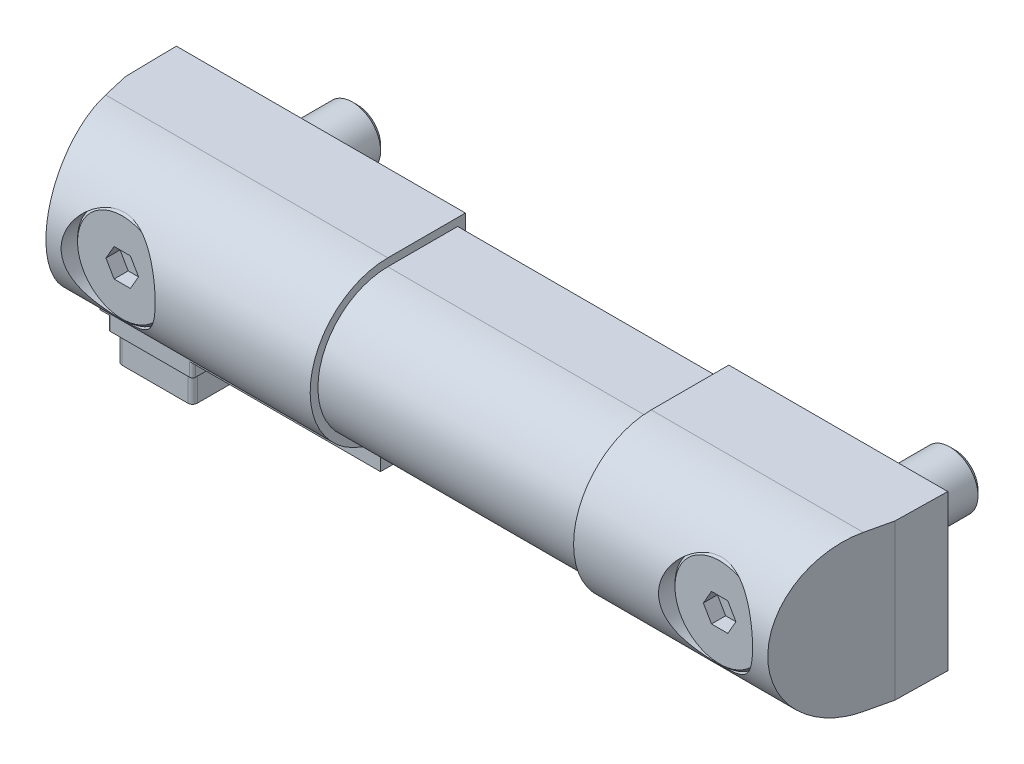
ISO-10303-21;
HEADER;
FILE_DESCRIPTION(('STEP AP214'),'2;1');
FILE_NAME('part.step','',(''),(''),'','','');
FILE_SCHEMA(('AUTOMOTIVE_DESIGN { 1 0 10303 214 1 1 1 1 }'));
ENDSEC;
DATA;
#1=APPLICATION_CONTEXT('core data for automotive mechanical design processes');
#2=APPLICATION_PROTOCOL_DEFINITION('international standard','automotive_design',2000,#1);
#3=PRODUCT_CONTEXT('',#1,'mechanical');
#4=PRODUCT('Part','Part','',(#3));
#5=PRODUCT_RELATED_PRODUCT_CATEGORY('part','',(#4));
#6=PRODUCT_DEFINITION_FORMATION('','',#4);
#7=PRODUCT_DEFINITION_CONTEXT('part definition',#1,'design');
#8=PRODUCT_DEFINITION('design','',#6,#7);
#9=PRODUCT_DEFINITION_SHAPE('','',#8);
#10=(LENGTH_UNIT() NAMED_UNIT(*) SI_UNIT(.MILLI.,.METRE.));
#11=(NAMED_UNIT(*) PLANE_ANGLE_UNIT() SI_UNIT($,.RADIAN.));
#12=(NAMED_UNIT(*) SI_UNIT($,.STERADIAN.) SOLID_ANGLE_UNIT());
#13=UNCERTAINTY_MEASURE_WITH_UNIT(LENGTH_MEASURE(1.E-05),#10,'distance_accuracy_value','');
#14=(GEOMETRIC_REPRESENTATION_CONTEXT(3) GLOBAL_UNCERTAINTY_ASSIGNED_CONTEXT((#13)) GLOBAL_UNIT_ASSIGNED_CONTEXT((#10,
#11,#12)) REPRESENTATION_CONTEXT('',''));
#15=CARTESIAN_POINT('',(0.,0.,0.));
#16=DIRECTION('',(0.,0.,1.));
#17=DIRECTION('',(1.,0.,0.));
#18=AXIS2_PLACEMENT_3D('',#15,#16,#17);
#19=CARTESIAN_POINT('',(63.5,0.,27.));
#20=DIRECTION('',(0.,0.,1.));
#21=DIRECTION('',(0.,-1.,0.));
#22=AXIS2_PLACEMENT_3D('',#19,#20,#21);
#23=PLANE('',#22);
#24=DIRECTION('',(-1.,0.,0.));
#25=VECTOR('',#24,1.);
#26=CARTESIAN_POINT('',(128.732050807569,3.,27.));
#27=LINE('',#26,#25);
#28=CARTESIAN_POINT('',(128.732050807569,3.,27.));
#29=VERTEX_POINT('',#28);
#30=CARTESIAN_POINT('',(125.267949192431,3.,27.));
#31=VERTEX_POINT('',#30);
#32=EDGE_CURVE('E378',#29,#31,#27,.T.);
#33=ORIENTED_EDGE('',*,*,#32,.T.);
#34=DIRECTION('',(-0.5,-0.866025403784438,0.));
#35=VECTOR('',#34,1.);
#36=CARTESIAN_POINT('',(125.267949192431,3.,27.));
#37=LINE('',#36,#35);
#38=CARTESIAN_POINT('',(123.535898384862,0.,27.));
#39=VERTEX_POINT('',#38);
#40=EDGE_CURVE('E381',#31,#39,#37,.T.);
#41=ORIENTED_EDGE('',*,*,#40,.T.);
#42=DIRECTION('',(0.5,-0.866025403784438,0.));
#43=VECTOR('',#42,1.);
#44=CARTESIAN_POINT('',(123.535898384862,0.,27.));
#45=LINE('',#44,#43);
#46=CARTESIAN_POINT('',(125.267949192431,-3.,27.));
#47=VERTEX_POINT('',#46);
#48=EDGE_CURVE('E385',#39,#47,#45,.T.);
#49=ORIENTED_EDGE('',*,*,#48,.T.);
#50=DIRECTION('',(1.,0.,0.));
#51=VECTOR('',#50,1.);
#52=CARTESIAN_POINT('',(125.267949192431,-3.,27.));
#53=LINE('',#52,#51);
#54=CARTESIAN_POINT('',(128.732050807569,-3.,27.));
#55=VERTEX_POINT('',#54);
#56=EDGE_CURVE('E388',#47,#55,#53,.T.);
#57=ORIENTED_EDGE('',*,*,#56,.T.);
#58=DIRECTION('',(0.5,0.866025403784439,0.));
#59=VECTOR('',#58,1.);
#60=CARTESIAN_POINT('',(128.732050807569,-3.,27.));
#61=LINE('',#60,#59);
#62=CARTESIAN_POINT('',(130.464101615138,0.,27.));
#63=VERTEX_POINT('',#62);
#64=EDGE_CURVE('E391',#55,#63,#61,.T.);
#65=ORIENTED_EDGE('',*,*,#64,.T.);
#66=DIRECTION('',(-0.5,0.866025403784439,0.));
#67=VECTOR('',#66,1.);
#68=CARTESIAN_POINT('',(130.464101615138,0.,27.));
#69=LINE('',#68,#67);
#70=EDGE_CURVE('E394',#63,#29,#69,.T.);
#71=ORIENTED_EDGE('',*,*,#70,.T.);
#72=EDGE_LOOP('',(#33,#41,#49,#57,#65,#71));
#73=FACE_BOUND('',#72,.T.);
#74=ADVANCED_FACE('F14',(#73),#23,.T.);
#75=CARTESIAN_POINT('',(128.732050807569,3.,27.));
#76=DIRECTION('',(0.,1.,0.));
#77=DIRECTION('',(0.,0.,1.));
#78=AXIS2_PLACEMENT_3D('',#75,#76,#77);
#79=PLANE('',#78);
#80=DIRECTION('',(-1.,0.,0.));
#81=VECTOR('',#80,1.);
#82=CARTESIAN_POINT('',(128.732050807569,3.,30.));
#83=LINE('',#82,#81);
#84=CARTESIAN_POINT('',(128.732050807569,3.,30.));
#85=VERTEX_POINT('',#84);
#86=CARTESIAN_POINT('',(125.267949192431,3.,30.));
#87=VERTEX_POINT('',#86);
#88=EDGE_CURVE('E327',#85,#87,#83,.T.);
#89=ORIENTED_EDGE('',*,*,#88,.T.);
#90=DIRECTION('',(0.,0.,1.));
#91=VECTOR('',#90,1.);
#92=CARTESIAN_POINT('',(125.267949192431,3.,27.));
#93=LINE('',#92,#91);
#94=EDGE_CURVE('E421',#31,#87,#93,.T.);
#95=ORIENTED_EDGE('',*,*,#94,.F.);
#96=ORIENTED_EDGE('',*,*,#32,.F.);
#97=DIRECTION('',(0.,0.,1.));
#98=VECTOR('',#97,1.);
#99=CARTESIAN_POINT('',(128.732050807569,3.,27.));
#100=LINE('',#99,#98);
#101=EDGE_CURVE('E397',#29,#85,#100,.T.);
#102=ORIENTED_EDGE('',*,*,#101,.T.);
#103=EDGE_LOOP('',(#89,#95,#96,#102));
#104=FACE_BOUND('',#103,.T.);
#105=ADVANCED_FACE('F781',(#104),#79,.F.);
#106=CARTESIAN_POINT('',(125.267949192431,3.,27.));
#107=DIRECTION('',(-0.866025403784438,0.5,0.));
#108=DIRECTION('',(-0.5,-0.866025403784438,0.));
#109=AXIS2_PLACEMENT_3D('',#106,#107,#108);
#110=PLANE('',#109);
#111=DIRECTION('',(-0.5,-0.866025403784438,0.));
#112=VECTOR('',#111,1.);
#113=CARTESIAN_POINT('',(125.267949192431,3.,30.));
#114=LINE('',#113,#112);
#115=CARTESIAN_POINT('',(123.535898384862,0.,30.));
#116=VERTEX_POINT('',#115);
#117=EDGE_CURVE('E400',#87,#116,#114,.T.);
#118=ORIENTED_EDGE('',*,*,#117,.T.);
#119=DIRECTION('',(0.,0.,1.));
#120=VECTOR('',#119,1.);
#121=CARTESIAN_POINT('',(123.535898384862,0.,27.));
#122=LINE('',#121,#120);
#123=EDGE_CURVE('E419',#39,#116,#122,.T.);
#124=ORIENTED_EDGE('',*,*,#123,.F.);
#125=ORIENTED_EDGE('',*,*,#40,.F.);
#126=ORIENTED_EDGE('',*,*,#94,.T.);
#127=EDGE_LOOP('',(#118,#124,#125,#126));
#128=FACE_BOUND('',#127,.T.);
#129=ADVANCED_FACE('F1039',(#128),#110,.F.);
#130=CARTESIAN_POINT('',(123.535898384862,0.,27.));
#131=DIRECTION('',(-0.866025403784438,-0.5,0.));
#132=DIRECTION('',(0.5,-0.866025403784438,0.));
#133=AXIS2_PLACEMENT_3D('',#130,#131,#132);
#134=PLANE('',#133);
#135=DIRECTION('',(0.5,-0.866025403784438,0.));
#136=VECTOR('',#135,1.);
#137=CARTESIAN_POINT('',(123.535898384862,0.,30.));
#138=LINE('',#137,#136);
#139=CARTESIAN_POINT('',(125.267949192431,-3.,30.));
#140=VERTEX_POINT('',#139);
#141=EDGE_CURVE('E403',#116,#140,#138,.T.);
#142=ORIENTED_EDGE('',*,*,#141,.T.);
#143=DIRECTION('',(0.,0.,1.));
#144=VECTOR('',#143,1.);
#145=CARTESIAN_POINT('',(125.267949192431,-3.,27.));
#146=LINE('',#145,#144);
#147=EDGE_CURVE('E417',#47,#140,#146,.T.);
#148=ORIENTED_EDGE('',*,*,#147,.F.);
#149=ORIENTED_EDGE('',*,*,#48,.F.);
#150=ORIENTED_EDGE('',*,*,#123,.T.);
#151=EDGE_LOOP('',(#142,#148,#149,#150));
#152=FACE_BOUND('',#151,.T.);
#153=ADVANCED_FACE('F1035',(#152),#134,.F.);
#154=CARTESIAN_POINT('',(125.267949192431,-3.,27.));
#155=DIRECTION('',(0.,-1.,0.));
#156=DIRECTION('',(0.,0.,-1.));
#157=AXIS2_PLACEMENT_3D('',#154,#155,#156);
#158=PLANE('',#157);
#159=DIRECTION('',(1.,0.,0.));
#160=VECTOR('',#159,1.);
#161=CARTESIAN_POINT('',(125.267949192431,-3.,30.));
#162=LINE('',#161,#160);
#163=CARTESIAN_POINT('',(128.732050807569,-3.,30.));
#164=VERTEX_POINT('',#163);
#165=EDGE_CURVE('E406',#140,#164,#162,.T.);
#166=ORIENTED_EDGE('',*,*,#165,.T.);
#167=DIRECTION('',(0.,0.,1.));
#168=VECTOR('',#167,1.);
#169=CARTESIAN_POINT('',(128.732050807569,-3.,27.));
#170=LINE('',#169,#168);
#171=EDGE_CURVE('E415',#55,#164,#170,.T.);
#172=ORIENTED_EDGE('',*,*,#171,.F.);
#173=ORIENTED_EDGE('',*,*,#56,.F.);
#174=ORIENTED_EDGE('',*,*,#147,.T.);
#175=EDGE_LOOP('',(#166,#172,#173,#174));
#176=FACE_BOUND('',#175,.T.);
#177=ADVANCED_FACE('F1032',(#176),#158,.F.);
#178=CARTESIAN_POINT('',(128.732050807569,-3.,27.));
#179=DIRECTION('',(0.866025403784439,-0.5,0.));
#180=DIRECTION('',(0.5,0.866025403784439,0.));
#181=AXIS2_PLACEMENT_3D('',#178,#179,#180);
#182=PLANE('',#181);
#183=DIRECTION('',(0.5,0.866025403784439,0.));
#184=VECTOR('',#183,1.);
#185=CARTESIAN_POINT('',(128.732050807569,-3.,30.));
#186=LINE('',#185,#184);
#187=CARTESIAN_POINT('',(130.464101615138,0.,30.));
#188=VERTEX_POINT('',#187);
#189=EDGE_CURVE('E41',#164,#188,#186,.T.);
#190=ORIENTED_EDGE('',*,*,#189,.T.);
#191=DIRECTION('',(0.,0.,1.));
#192=VECTOR('',#191,1.);
#193=CARTESIAN_POINT('',(130.464101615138,0.,27.));
#194=LINE('',#193,#192);
#195=EDGE_CURVE('E413',#63,#188,#194,.T.);
#196=ORIENTED_EDGE('',*,*,#195,.F.);
#197=ORIENTED_EDGE('',*,*,#64,.F.);
#198=ORIENTED_EDGE('',*,*,#171,.T.);
#199=EDGE_LOOP('',(#190,#196,#197,#198));
#200=FACE_BOUND('',#199,.T.);
#201=ADVANCED_FACE('F1028',(#200),#182,.F.);
#202=CARTESIAN_POINT('',(130.464101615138,0.,27.));
#203=DIRECTION('',(0.866025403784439,0.5,0.));
#204=DIRECTION('',(-0.5,0.866025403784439,0.));
#205=AXIS2_PLACEMENT_3D('',#202,#203,#204);
#206=PLANE('',#205);
#207=DIRECTION('',(-0.5,0.866025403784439,0.));
#208=VECTOR('',#207,1.);
#209=CARTESIAN_POINT('',(130.464101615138,0.,30.));
#210=LINE('',#209,#208);
#211=EDGE_CURVE('E382',#188,#85,#210,.T.);
#212=ORIENTED_EDGE('',*,*,#211,.T.);
#213=ORIENTED_EDGE('',*,*,#101,.F.);
#214=ORIENTED_EDGE('',*,*,#70,.F.);
#215=ORIENTED_EDGE('',*,*,#195,.T.);
#216=EDGE_LOOP('',(#212,#213,#214,#215));
#217=FACE_BOUND('',#216,.T.);
#218=ADVANCED_FACE('F991',(#217),#206,.F.);
#219=CARTESIAN_POINT('',(131.9265,0.,-20.));
#220=DIRECTION('',(0.,0.,1.));
#221=DIRECTION('',(0.,-1.,0.));
#222=AXIS2_PLACEMENT_3D('',#219,#220,#221);
#223=PLANE('',#222);
#224=CARTESIAN_POINT('',(127.,0.,-20.));
#225=DIRECTION('',(0.,0.,-1.));
#226=DIRECTION('',(0.,1.,0.));
#227=AXIS2_PLACEMENT_3D('',#224,#225,#226);
#228=CIRCLE('',#227,4.9265);
#229=CARTESIAN_POINT('',(127.,4.9265,-20.));
#230=VERTEX_POINT('',#229);
#231=EDGE_CURVE('E441',#230,#230,#228,.T.);
#232=ORIENTED_EDGE('',*,*,#231,.T.);
#233=EDGE_LOOP('',(#232));
#234=FACE_BOUND('',#233,.T.);
#235=ADVANCED_FACE('F963',(#234),#223,.F.);
#236=CARTESIAN_POINT('',(145.5,0.,16.5));
#237=DIRECTION('',(-1.,0.,0.));
#238=DIRECTION('',(0.,0.,-1.));
#239=AXIS2_PLACEMENT_3D('',#236,#237,#238);
#240=CYLINDRICAL_SURFACE('',#239,16.5);
#241=CARTESIAN_POINT('',(126.189666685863,9.41499229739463,30.0502));
#242=CARTESIAN_POINT('',(126.256299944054,9.4339463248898,30.0370297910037));
#243=CARTESIAN_POINT('',(126.323777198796,9.45089152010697,30.0251977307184));
#244=CARTESIAN_POINT('',(126.460247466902,9.48029558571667,30.00460350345));
#245=CARTESIAN_POINT('',(126.529242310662,9.49274868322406,29.9958452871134));
#246=CARTESIAN_POINT('',(126.733679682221,9.52198337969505,29.9752531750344));
#247=CARTESIAN_POINT('',(126.870736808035,9.53186572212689,29.9682419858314));
#248=CARTESIAN_POINT('',(127.142250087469,9.53111572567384,29.9687722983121));
#249=CARTESIAN_POINT('',(127.276708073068,9.52085438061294,29.9760506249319));
#250=CARTESIAN_POINT('',(127.477251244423,9.49161789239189,29.9966407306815));
#251=CARTESIAN_POINT('',(127.544909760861,9.47927049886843,30.0053227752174));
#252=CARTESIAN_POINT('',(127.678759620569,9.45025408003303,30.0256427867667));
#253=CARTESIAN_POINT('',(127.744952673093,9.43359041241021,30.0372770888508));
#254=CARTESIAN_POINT('',(127.810333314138,9.41499229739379,30.0502000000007));
#255=B_SPLINE_CURVE_WITH_KNOTS('',3,(#241,#242,#243,#244,#245,#246,#247,#248,#249,#250,#251,
#252,#253,#254),.UNSPECIFIED.,.F.,.F.,(4,2,2,2,2,2,4),(0.,0.211497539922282,0.423265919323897,
0.83370205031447,1.23664991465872,1.44443080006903,1.65195499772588),.UNSPECIFIED.);
#256=CARTESIAN_POINT('',(126.5,9.48683298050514,30.));
#257=VERTEX_POINT('',#256);
#258=CARTESIAN_POINT('',(127.5,9.48683298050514,30.));
#259=VERTEX_POINT('',#258);
#260=EDGE_CURVE('E720',#257,#259,#255,.T.);
#261=ORIENTED_EDGE('',*,*,#260,.F.);
#262=DIRECTION('',(-1.,0.,0.));
#263=VECTOR('',#262,1.);
#264=CARTESIAN_POINT('',(145.5,9.48683298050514,30.));
#265=LINE('',#264,#263);
#266=EDGE_CURVE('E703',#259,#257,#265,.T.);
#267=ORIENTED_EDGE('',*,*,#266,.F.);
#268=EDGE_LOOP('',(#261,#267));
#269=FACE_BOUND('',#268,.T.);
#270=ADVANCED_FACE('F784',(#269),#240,.T.);
#271=CARTESIAN_POINT('',(127.810333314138,-9.41499229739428,30.0502));
#272=CARTESIAN_POINT('',(127.743700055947,-9.4339463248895,30.0370297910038));
#273=CARTESIAN_POINT('',(127.676222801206,-9.45089152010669,30.0251977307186));
#274=CARTESIAN_POINT('',(127.539752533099,-9.48029558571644,30.0046035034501));
#275=CARTESIAN_POINT('',(127.470757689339,-9.49274868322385,29.9958452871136));
#276=CARTESIAN_POINT('',(127.26632031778,-9.52198337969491,29.9752531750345));
#277=CARTESIAN_POINT('',(127.129263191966,-9.53186572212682,29.9682419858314));
#278=CARTESIAN_POINT('',(126.857749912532,-9.5311157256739,29.9687722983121));
#279=CARTESIAN_POINT('',(126.723291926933,-9.52085438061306,29.9760506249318));
#280=CARTESIAN_POINT('',(126.522748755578,-9.49161789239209,29.9966407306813));
#281=CARTESIAN_POINT('',(126.45509023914,-9.47927049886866,30.0053227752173));
#282=CARTESIAN_POINT('',(126.321240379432,-9.45025408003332,30.0256427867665));
#283=CARTESIAN_POINT('',(126.255047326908,-9.43359041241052,30.0372770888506));
#284=CARTESIAN_POINT('',(126.189666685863,-9.41499229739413,30.0502000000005));
#285=B_SPLINE_CURVE_WITH_KNOTS('',3,(#271,#272,#273,#274,#275,#276,#277,#278,#279,#280,#281,
#282,#283,#284),.UNSPECIFIED.,.F.,.F.,(4,2,2,2,2,2,4),(0.,0.211497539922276,0.423265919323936,
0.833702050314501,1.23664991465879,1.44443080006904,1.65195499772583),.UNSPECIFIED.);
#286=CARTESIAN_POINT('',(127.5,-9.48683298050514,30.));
#287=VERTEX_POINT('',#286);
#288=CARTESIAN_POINT('',(126.5,-9.48683298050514,30.));
#289=VERTEX_POINT('',#288);
#290=EDGE_CURVE('E695',#287,#289,#285,.T.);
#291=ORIENTED_EDGE('',*,*,#290,.F.);
#292=DIRECTION('',(-1.,0.,0.));
#293=VECTOR('',#292,1.);
#294=CARTESIAN_POINT('',(145.5,-9.48683298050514,30.));
#295=LINE('',#294,#293);
#296=EDGE_CURVE('E692',#289,#287,#295,.F.);
#297=ORIENTED_EDGE('',*,*,#296,.F.);
#298=EDGE_LOOP('',(#291,#297));
#299=FACE_BOUND('',#298,.T.);
#300=ADVANCED_FACE('F790',(#299),#240,.T.);
#301=CARTESIAN_POINT('',(136.5,0.,30.));
#302=DIRECTION('',(0.,0.,1.));
#303=DIRECTION('',(0.,-1.,0.));
#304=AXIS2_PLACEMENT_3D('',#301,#302,#303);
#305=PLANE('',#304);
#306=ORIENTED_EDGE('',*,*,#211,.F.);
#307=ORIENTED_EDGE('',*,*,#189,.F.);
#308=ORIENTED_EDGE('',*,*,#165,.F.);
#309=ORIENTED_EDGE('',*,*,#141,.F.);
#310=ORIENTED_EDGE('',*,*,#117,.F.);
#311=ORIENTED_EDGE('',*,*,#88,.F.);
#312=EDGE_LOOP('',(#306,#307,#308,#309,#310,#311));
#313=FACE_BOUND('',#312,.T.);
#314=ORIENTED_EDGE('',*,*,#296,.T.);
#315=CARTESIAN_POINT('',(127.,0.,30.));
#316=DIRECTION('',(0.,0.,-1.));
#317=DIRECTION('',(0.,1.,0.));
#318=AXIS2_PLACEMENT_3D('',#315,#316,#317);
#319=CIRCLE('',#318,9.5);
#320=EDGE_CURVE('E429',#259,#287,#319,.T.);
#321=ORIENTED_EDGE('',*,*,#320,.F.);
#322=ORIENTED_EDGE('',*,*,#266,.T.);
#323=EDGE_CURVE('E431',#289,#257,#319,.T.);
#324=ORIENTED_EDGE('',*,*,#323,.F.);
#325=EDGE_LOOP('',(#314,#321,#322,#324));
#326=FACE_BOUND('',#325,.T.);
#327=ADVANCED_FACE('F715',(#313,#326),#305,.T.);
#328=CARTESIAN_POINT('',(127.,0.,-18.9265));
#329=DIRECTION('',(0.,0.,1.));
#330=DIRECTION('',(0.,-1.,0.));
#331=AXIS2_PLACEMENT_3D('',#328,#329,#330);
#332=CONICAL_SURFACE('',#331,6.,0.785398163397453);
#333=ORIENTED_EDGE('',*,*,#231,.F.);
#334=EDGE_LOOP('',(#333));
#335=FACE_BOUND('',#334,.T.);
#336=CARTESIAN_POINT('',(127.,0.,-18.9265));
#337=DIRECTION('',(0.,0.,-1.));
#338=DIRECTION('',(0.,1.,0.));
#339=AXIS2_PLACEMENT_3D('',#336,#337,#338);
#340=CIRCLE('',#339,6.);
#341=CARTESIAN_POINT('',(127.,6.,-18.9265));
#342=VERTEX_POINT('',#341);
#343=EDGE_CURVE('E444',#342,#342,#340,.T.);
#344=ORIENTED_EDGE('',*,*,#343,.T.);
#345=EDGE_LOOP('',(#344));
#346=FACE_BOUND('',#345,.T.);
#347=ADVANCED_FACE('F713',(#335,#346),#332,.T.);
#348=CARTESIAN_POINT('',(127.,0.,29.5));
#349=DIRECTION('',(0.,0.,-1.));
#350=DIRECTION('',(0.,1.,0.));
#351=AXIS2_PLACEMENT_3D('',#348,#349,#350);
#352=CONICAL_SURFACE('',#351,10.,0.785398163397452);
#353=ORIENTED_EDGE('',*,*,#320,.T.);
#354=ORIENTED_EDGE('',*,*,#290,.T.);
#355=ORIENTED_EDGE('',*,*,#323,.T.);
#356=ORIENTED_EDGE('',*,*,#260,.T.);
#357=EDGE_LOOP('',(#353,#354,#355,#356));
#358=FACE_BOUND('',#357,.T.);
#359=CARTESIAN_POINT('',(127.,0.,29.5));
#360=DIRECTION('',(0.,0.,-1.));
#361=DIRECTION('',(0.,1.,0.));
#362=AXIS2_PLACEMENT_3D('',#359,#360,#361);
#363=CIRCLE('',#362,10.);
#364=CARTESIAN_POINT('',(127.,10.,29.5));
#365=VERTEX_POINT('',#364);
#366=EDGE_CURVE('E432',#365,#365,#363,.T.);
#367=ORIENTED_EDGE('',*,*,#366,.F.);
#368=EDGE_LOOP('',(#367));
#369=FACE_BOUND('',#368,.T.);
#370=ADVANCED_FACE('F708',(#358,#369),#352,.T.);
#371=CARTESIAN_POINT('',(63.5,0.,27.));
#372=DIRECTION('',(0.,0.,1.));
#373=DIRECTION('',(0.,-1.,0.));
#374=AXIS2_PLACEMENT_3D('',#371,#372,#373);
#375=PLANE('',#374);
#376=DIRECTION('',(-1.,0.,0.));
#377=VECTOR('',#376,1.);
#378=CARTESIAN_POINT('',(1.7320508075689,3.,27.));
#379=LINE('',#378,#377);
#380=CARTESIAN_POINT('',(1.7320508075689,3.,27.));
#381=VERTEX_POINT('',#380);
#382=CARTESIAN_POINT('',(-1.7320508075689,3.,27.));
#383=VERTEX_POINT('',#382);
#384=EDGE_CURVE('E321',#381,#383,#379,.T.);
#385=ORIENTED_EDGE('',*,*,#384,.T.);
#386=DIRECTION('',(-0.5,-0.866025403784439,0.));
#387=VECTOR('',#386,1.);
#388=CARTESIAN_POINT('',(-1.7320508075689,3.,27.));
#389=LINE('',#388,#387);
#390=CARTESIAN_POINT('',(-3.4641016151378,0.,27.));
#391=VERTEX_POINT('',#390);
#392=EDGE_CURVE('E331',#383,#391,#389,.T.);
#393=ORIENTED_EDGE('',*,*,#392,.T.);
#394=DIRECTION('',(0.5,-0.866025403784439,0.));
#395=VECTOR('',#394,1.);
#396=CARTESIAN_POINT('',(-3.4641016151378,0.,27.));
#397=LINE('',#396,#395);
#398=CARTESIAN_POINT('',(-1.7320508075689,-3.,27.));
#399=VERTEX_POINT('',#398);
#400=EDGE_CURVE('E336',#391,#399,#397,.T.);
#401=ORIENTED_EDGE('',*,*,#400,.T.);
#402=DIRECTION('',(1.,0.,0.));
#403=VECTOR('',#402,1.);
#404=CARTESIAN_POINT('',(-1.7320508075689,-3.,27.));
#405=LINE('',#404,#403);
#406=CARTESIAN_POINT('',(1.7320508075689,-3.,27.));
#407=VERTEX_POINT('',#406);
#408=EDGE_CURVE('E352',#399,#407,#405,.T.);
#409=ORIENTED_EDGE('',*,*,#408,.T.);
#410=DIRECTION('',(0.5,0.866025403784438,0.));
#411=VECTOR('',#410,1.);
#412=CARTESIAN_POINT('',(1.7320508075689,-3.,27.));
#413=LINE('',#412,#411);
#414=CARTESIAN_POINT('',(3.4641016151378,0.,27.));
#415=VERTEX_POINT('',#414);
#416=EDGE_CURVE('E355',#407,#415,#413,.T.);
#417=ORIENTED_EDGE('',*,*,#416,.T.);
#418=DIRECTION('',(-0.5,0.866025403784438,0.));
#419=VECTOR('',#418,1.);
#420=CARTESIAN_POINT('',(3.4641016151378,0.,27.));
#421=LINE('',#420,#419);
#422=EDGE_CURVE('E342',#415,#381,#421,.T.);
#423=ORIENTED_EDGE('',*,*,#422,.T.);
#424=EDGE_LOOP('',(#385,#393,#401,#409,#417,#423));
#425=FACE_BOUND('',#424,.T.);
#426=ADVANCED_FACE('F339',(#425),#375,.T.);
#427=CARTESIAN_POINT('',(127.,0.,-20.));
#428=DIRECTION('',(0.,0.,-1.));
#429=DIRECTION('',(0.,1.,0.));
#430=AXIS2_PLACEMENT_3D('',#427,#428,#429);
#431=CYLINDRICAL_SURFACE('',#430,6.);
#432=ORIENTED_EDGE('',*,*,#343,.F.);
#433=EDGE_LOOP('',(#432));
#434=FACE_BOUND('',#433,.T.);
#435=CARTESIAN_POINT('',(127.,0.,0.));
#436=DIRECTION('',(0.,0.,1.));
#437=DIRECTION('',(0.,-1.,0.));
#438=AXIS2_PLACEMENT_3D('',#435,#436,#437);
#439=CIRCLE('',#438,6.);
#440=CARTESIAN_POINT('',(127.,-6.,0.));
#441=VERTEX_POINT('',#440);
#442=EDGE_CURVE('E686',#441,#441,#439,.F.);
#443=ORIENTED_EDGE('',*,*,#442,.T.);
#444=EDGE_LOOP('',(#443));
#445=FACE_BOUND('',#444,.T.);
#446=ADVANCED_FACE('F808',(#434,#445),#431,.T.);
#447=CARTESIAN_POINT('',(145.30799428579,-33.,11.));
#448=DIRECTION('',(0.999847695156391,0.,0.0174524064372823));
#449=DIRECTION('',(-0.0174524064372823,0.,0.999847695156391));
#450=AXIS2_PLACEMENT_3D('',#447,#448,#449);
#451=PLANE('',#450);
#452=DIRECTION('',(0.0174524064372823,0.,-0.999847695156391));
#453=VECTOR('',#452,1.);
#454=CARTESIAN_POINT('',(145.212079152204,-16.5,16.4949743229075));
#455=LINE('',#454,#453);
#456=CARTESIAN_POINT('',(145.30799428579,-16.5,11.));
#457=VERTEX_POINT('',#456);
#458=CARTESIAN_POINT('',(145.5,-16.5,0.));
#459=VERTEX_POINT('',#458);
#460=EDGE_CURVE('E455',#457,#459,#455,.T.);
#461=ORIENTED_EDGE('',*,*,#460,.T.);
#462=DIRECTION('',(0.,1.,0.));
#463=VECTOR('',#462,1.);
#464=CARTESIAN_POINT('',(145.5,-16.5,0.));
#465=LINE('',#464,#463);
#466=CARTESIAN_POINT('',(145.5,16.5,0.));
#467=VERTEX_POINT('',#466);
#468=EDGE_CURVE('E654',#459,#467,#465,.T.);
#469=ORIENTED_EDGE('',*,*,#468,.T.);
#470=DIRECTION('',(-0.0174524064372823,0.,0.999847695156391));
#471=VECTOR('',#470,1.);
#472=CARTESIAN_POINT('',(145.5,16.5,0.));
#473=LINE('',#472,#471);
#474=CARTESIAN_POINT('',(145.30799428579,16.5,11.));
#475=VERTEX_POINT('',#474);
#476=EDGE_CURVE('E453',#467,#475,#473,.T.);
#477=ORIENTED_EDGE('',*,*,#476,.T.);
#478=DIRECTION('',(0.,1.,0.));
#479=VECTOR('',#478,1.);
#480=CARTESIAN_POINT('',(145.30799428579,-33.,11.));
#481=LINE('',#480,#479);
#482=EDGE_CURVE('E447',#457,#475,#481,.T.);
#483=ORIENTED_EDGE('',*,*,#482,.F.);
#484=EDGE_LOOP('',(#461,#469,#477,#483));
#485=FACE_BOUND('',#484,.T.);
#486=ADVANCED_FACE('F886',(#485),#451,.T.);
#487=CARTESIAN_POINT('',(127.,0.,30.));
#488=DIRECTION('',(0.,0.,-1.));
#489=DIRECTION('',(0.,1.,0.));
#490=AXIS2_PLACEMENT_3D('',#487,#488,#489);
#491=CYLINDRICAL_SURFACE('',#490,10.);
#492=ORIENTED_EDGE('',*,*,#366,.T.);
#493=EDGE_LOOP('',(#492));
#494=FACE_BOUND('',#493,.T.);
#495=CARTESIAN_POINT('',(127.,10.,29.6244047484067));
#496=CARTESIAN_POINT('',(126.749451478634,9.99999727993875,29.6244089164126));
#497=CARTESIAN_POINT('',(126.498814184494,9.9905642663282,29.6316108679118));
#498=CARTESIAN_POINT('',(125.999637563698,9.95298990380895,29.6601111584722));
#499=CARTESIAN_POINT('',(125.751099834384,9.92483541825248,29.6814193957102));
#500=CARTESIAN_POINT('',(125.257706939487,9.85021865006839,29.7372716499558));
#501=CARTESIAN_POINT('',(125.012861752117,9.80371368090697,29.771846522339));
#502=CARTESIAN_POINT('',(124.529086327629,9.69310075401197,29.852845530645));
#503=CARTESIAN_POINT('',(124.290159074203,9.62898410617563,29.8992755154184));
#504=CARTESIAN_POINT('',(123.821774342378,9.48464130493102,30.0018271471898));
#505=CARTESIAN_POINT('',(123.592252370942,9.40456077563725,30.0578605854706));
#506=CARTESIAN_POINT('',(123.141423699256,9.22875714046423,30.1781351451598));
#507=CARTESIAN_POINT('',(122.920120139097,9.13302812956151,30.2423793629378));
#508=CARTESIAN_POINT('',(122.486675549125,8.92678470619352,30.3772361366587));
#509=CARTESIAN_POINT('',(122.274530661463,8.81627660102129,30.4478459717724));
#510=CARTESIAN_POINT('',(121.859896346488,8.58115049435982,30.5937219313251));
#511=CARTESIAN_POINT('',(121.657407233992,8.45653203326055,30.6689882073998));
#512=CARTESIAN_POINT('',(121.237814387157,8.17731243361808,30.832162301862));
#513=CARTESIAN_POINT('',(121.022063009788,8.02091114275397,30.9204716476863));
#514=CARTESIAN_POINT('',(120.604163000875,7.69181354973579,31.0986648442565));
#515=CARTESIAN_POINT('',(120.402011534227,7.51912066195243,31.1885483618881));
#516=CARTESIAN_POINT('',(120.011804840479,7.15792313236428,31.3679126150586));
#517=CARTESIAN_POINT('',(119.823761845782,6.9694050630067,31.457392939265));
#518=CARTESIAN_POINT('',(119.462756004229,6.57730830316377,31.6339107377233));
#519=CARTESIAN_POINT('',(119.289795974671,6.37372681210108,31.7209477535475));
#520=CARTESIAN_POINT('',(118.941543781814,5.92872172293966,31.9001298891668));
#521=CARTESIAN_POINT('',(118.768138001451,5.68560890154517,31.9917640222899));
#522=CARTESIAN_POINT('',(118.442720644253,5.18291135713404,32.1671073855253));
#523=CARTESIAN_POINT('',(118.290699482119,4.92333409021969,32.2508201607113));
#524=CARTESIAN_POINT('',(118.009657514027,4.3891649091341,32.4079442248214));
#525=CARTESIAN_POINT('',(117.880626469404,4.11457975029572,32.4813600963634));
#526=CARTESIAN_POINT('',(117.647214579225,3.5521890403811,32.6156904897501));
#527=CARTESIAN_POINT('',(117.542829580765,3.26438572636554,32.676607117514));
#528=CARTESIAN_POINT('',(117.369191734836,2.70637242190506,32.7787603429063));
#529=CARTESIAN_POINT('',(117.297514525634,2.43716048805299,32.8213320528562));
#530=CARTESIAN_POINT('',(117.176649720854,1.89201242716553,32.8934698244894));
#531=CARTESIAN_POINT('',(117.127460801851,1.61607669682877,32.9230366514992));
#532=CARTESIAN_POINT('',(117.052402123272,1.06014571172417,32.968266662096));
#533=CARTESIAN_POINT('',(117.026513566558,0.780153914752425,32.9839410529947));
#534=CARTESIAN_POINT('',(116.998437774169,0.218560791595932,33.0009428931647));
#535=CARTESIAN_POINT('',(116.996248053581,-0.0630403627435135,33.00227184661));
#536=CARTESIAN_POINT('',(117.014367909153,-0.589481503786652,32.9912952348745));
#537=CARTESIAN_POINT('',(117.031863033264,-0.83446028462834,32.9806951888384));
#538=CARTESIAN_POINT('',(117.084711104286,-1.32178088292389,32.9487843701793));
#539=CARTESIAN_POINT('',(117.120063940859,-1.56412271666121,32.9274736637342));
#540=CARTESIAN_POINT('',(117.208178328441,-2.04447088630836,32.8746307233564));
#541=CARTESIAN_POINT('',(117.26093967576,-2.28247727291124,32.8430986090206));
#542=CARTESIAN_POINT('',(117.383247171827,-2.75264906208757,32.7705105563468));
#543=CARTESIAN_POINT('',(117.452794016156,-2.98481422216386,32.7294542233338));
#544=CARTESIAN_POINT('',(117.608293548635,-3.44306234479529,32.6384682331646));
#545=CARTESIAN_POINT('',(117.694323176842,-3.66911087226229,32.5884970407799));
#546=CARTESIAN_POINT('',(117.881771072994,-4.11290023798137,32.4808076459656));
#547=CARTESIAN_POINT('',(117.983194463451,-4.33063828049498,32.423086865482));
#548=CARTESIAN_POINT('',(118.200539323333,-4.75675178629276,32.3010260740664));
#549=CARTESIAN_POINT('',(118.316458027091,-4.96512902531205,32.2366873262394));
#550=CARTESIAN_POINT('',(118.56202284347,-5.37187163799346,32.1025280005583));
#551=CARTESIAN_POINT('',(118.691673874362,-5.57023338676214,32.0327054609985));
#552=CARTESIAN_POINT('',(118.980289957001,-5.97948706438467,31.8801489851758));
#553=CARTESIAN_POINT('',(119.140905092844,-6.18901433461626,31.7968724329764));
#554=CARTESIAN_POINT('',(119.477446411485,-6.59397786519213,31.6267222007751));
#555=CARTESIAN_POINT('',(119.65337958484,-6.7894076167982,31.5398468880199));
#556=CARTESIAN_POINT('',(120.01984544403,-7.16564591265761,31.3642745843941));
#557=CARTESIAN_POINT('',(120.210394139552,-7.34643796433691,31.2755756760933));
#558=CARTESIAN_POINT('',(120.605167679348,-7.69253107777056,31.0983823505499));
#559=CARTESIAN_POINT('',(120.80939301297,-7.85783158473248,31.0098879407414));
#560=CARTESIAN_POINT('',(121.256069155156,-8.19108722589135,30.8246861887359));
#561=CARTESIAN_POINT('',(121.500170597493,-8.35699585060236,30.7282622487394));
#562=CARTESIAN_POINT('',(122.003790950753,-8.66749171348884,30.5412765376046));
#563=CARTESIAN_POINT('',(122.263312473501,-8.81207532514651,30.4507157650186));
#564=CARTESIAN_POINT('',(122.79627073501,-9.07839554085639,30.2788902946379));
#565=CARTESIAN_POINT('',(123.0696857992,-9.20016642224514,30.197611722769));
#566=CARTESIAN_POINT('',(123.629319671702,-9.41959402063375,30.047654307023));
#567=CARTESIAN_POINT('',(123.915533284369,-9.51726041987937,29.978970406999));
#568=CARTESIAN_POINT('',(124.425361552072,-9.6655533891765,29.872851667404));
#569=CARTESIAN_POINT('',(124.646614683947,-9.72183281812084,29.8319021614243));
#570=CARTESIAN_POINT('',(125.094023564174,-9.81935029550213,29.7602425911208));
#571=CARTESIAN_POINT('',(125.320178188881,-9.86059175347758,29.7295302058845));
#572=CARTESIAN_POINT('',(125.775803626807,-9.92745207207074,29.6794326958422));
#573=CARTESIAN_POINT('',(126.0052708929,-9.95308653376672,29.6600362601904));
#574=CARTESIAN_POINT('',(126.466141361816,-9.98841339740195,29.6332438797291));
#575=CARTESIAN_POINT('',(126.697544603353,-9.99810547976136,29.6258481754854));
#576=CARTESIAN_POINT('',(127.160898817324,-10.0013935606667,29.6233430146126));
#577=CARTESIAN_POINT('',(127.392850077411,-9.99496409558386,29.6282529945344));
#578=CARTESIAN_POINT('',(127.855165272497,-9.9660593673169,29.650208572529));
#579=CARTESIAN_POINT('',(128.085529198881,-9.94358401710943,29.6672542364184));
#580=CARTESIAN_POINT('',(128.543170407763,-9.8829118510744,29.712853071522));
#581=CARTESIAN_POINT('',(128.770445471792,-9.84470429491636,29.7414141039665));
#582=CARTESIAN_POINT('',(129.220307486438,-9.75309891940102,29.8090305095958));
#583=CARTESIAN_POINT('',(129.442894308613,-9.69970068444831,29.8480861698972));
#584=CARTESIAN_POINT('',(129.881099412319,-9.5786574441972,29.9352091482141));
#585=CARTESIAN_POINT('',(130.096746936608,-9.51108489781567,29.9832305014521));
#586=CARTESIAN_POINT('',(130.521358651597,-9.36219458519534,30.0870358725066));
#587=CARTESIAN_POINT('',(130.730320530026,-9.28087212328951,30.1428225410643));
#588=CARTESIAN_POINT('',(131.345974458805,-9.01730269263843,30.3196607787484));
#589=CARTESIAN_POINT('',(131.741649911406,-8.81539340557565,30.4502358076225));
#590=CARTESIAN_POINT('',(132.568645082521,-8.32241190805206,30.750790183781));
#591=CARTESIAN_POINT('',(132.993242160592,-8.02178535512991,30.9236080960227));
#592=CARTESIAN_POINT('',(133.59077173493,-7.52522015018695,31.1852414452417));
#593=CARTESIAN_POINT('',(133.78352378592,-7.35193937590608,31.2729237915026));
#594=CARTESIAN_POINT('',(134.155308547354,-6.99061803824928,31.4472889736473));
#595=CARTESIAN_POINT('',(134.334338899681,-6.80257494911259,31.5339716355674));
#596=CARTESIAN_POINT('',(134.701434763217,-6.38555565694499,31.7162195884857));
#597=CARTESIAN_POINT('',(134.887358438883,-6.15450617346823,31.8113676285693));
#598=CARTESIAN_POINT('',(135.238919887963,-5.67525068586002,31.9953987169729));
#599=CARTESIAN_POINT('',(135.404565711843,-5.4270515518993,32.084284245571));
#600=CARTESIAN_POINT('',(135.714100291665,-4.91467336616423,32.253372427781));
#601=CARTESIAN_POINT('',(135.857993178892,-4.65049736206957,32.3335767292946));
#602=CARTESIAN_POINT('',(136.122379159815,-4.10771082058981,32.4829879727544));
#603=CARTESIAN_POINT('',(136.242875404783,-3.82910223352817,32.5521963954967));
#604=CARTESIAN_POINT('',(136.451230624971,-3.27940348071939,32.6730974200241));
#605=CARTESIAN_POINT('',(136.540783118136,-3.00915089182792,32.7256766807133));
#606=CARTESIAN_POINT('',(136.696919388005,-2.45992602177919,32.8179739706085));
#607=CARTESIAN_POINT('',(136.763503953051,-2.18095404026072,32.8576924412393));
#608=CARTESIAN_POINT('',(136.87257525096,-1.61699192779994,32.9230276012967));
#609=CARTESIAN_POINT('',(136.915085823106,-1.33200804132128,32.9486582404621));
#610=CARTESIAN_POINT('',(136.975357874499,-0.758506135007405,32.9850592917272));
#611=CARTESIAN_POINT('',(136.993122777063,-0.469988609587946,32.9958317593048));
#612=CARTESIAN_POINT('',(137.002876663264,0.0680414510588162,33.0017437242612));
#613=CARTESIAN_POINT('',(136.998063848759,0.317481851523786,32.99882295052));
#614=CARTESIAN_POINT('',(136.969853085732,0.814902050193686,32.9817426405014));
#615=CARTESIAN_POINT('',(136.946457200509,1.06288200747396,32.9675843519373));
#616=CARTESIAN_POINT('',(136.88139788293,1.55554553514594,32.9283703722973));
#617=CARTESIAN_POINT('',(136.839734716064,1.80022915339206,32.9033148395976));
#618=CARTESIAN_POINT('',(136.738674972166,2.28460549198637,32.8428929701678));
#619=CARTESIAN_POINT('',(136.679277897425,2.52429807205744,32.8075263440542));
#620=CARTESIAN_POINT('',(136.544853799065,2.99229378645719,32.728103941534));
#621=CARTESIAN_POINT('',(136.470173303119,3.22072977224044,32.6842418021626));
#622=CARTESIAN_POINT('',(136.305214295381,3.67019328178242,32.5882725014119));
#623=CARTESIAN_POINT('',(136.214930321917,3.89121817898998,32.5361624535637));
#624=CARTESIAN_POINT('',(136.019621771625,4.32468773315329,32.4247338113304));
#625=CARTESIAN_POINT('',(135.914600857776,4.5371345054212,32.3654170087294));
#626=CARTESIAN_POINT('',(135.690582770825,4.95272900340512,32.2406344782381));
#627=CARTESIAN_POINT('',(135.571580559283,5.15587333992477,32.1751665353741));
#628=CARTESIAN_POINT('',(135.306927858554,5.57336647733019,32.0319467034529));
#629=CARTESIAN_POINT('',(135.159788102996,5.78657827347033,31.9536305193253));
#630=CARTESIAN_POINT('',(134.850290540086,6.19997176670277,31.7924687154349));
#631=CARTESIAN_POINT('',(134.687925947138,6.40014758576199,31.7096210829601));
#632=CARTESIAN_POINT('',(134.348760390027,6.78689393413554,31.5410307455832));
#633=CARTESIAN_POINT('',(134.171947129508,6.97345261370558,31.455285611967));
#634=CARTESIAN_POINT('',(133.804771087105,7.33218780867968,31.2827145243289));
#635=CARTESIAN_POINT('',(133.614407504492,7.50436347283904,31.1958885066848));
#636=CARTESIAN_POINT('',(133.194904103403,7.85541111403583,31.0116091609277));
#637=CARTESIAN_POINT('',(132.963957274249,8.03218549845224,30.9142600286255));
#638=CARTESIAN_POINT('',(132.486436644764,8.36563384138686,30.7233292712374));
#639=CARTESIAN_POINT('',(132.239860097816,8.5223042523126,30.6297483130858));
#640=CARTESIAN_POINT('',(131.732162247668,8.81432663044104,30.4494473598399));
#641=CARTESIAN_POINT('',(131.47104850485,8.94968954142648,30.3627238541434));
#642=CARTESIAN_POINT('',(130.935331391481,9.19783858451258,30.1993374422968));
#643=CARTESIAN_POINT('',(130.660732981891,9.31063294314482,30.1226708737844));
#644=CARTESIAN_POINT('',(130.162237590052,9.48967272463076,29.998340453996));
#645=CARTESIAN_POINT('',(129.940706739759,9.56068851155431,29.9480227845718));
#646=CARTESIAN_POINT('',(129.491417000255,9.68748105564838,29.856976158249));
#647=CARTESIAN_POINT('',(129.263659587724,9.74326139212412,29.8162449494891));
#648=CARTESIAN_POINT('',(128.80379356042,9.83876672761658,29.7458365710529));
#649=CARTESIAN_POINT('',(128.571698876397,9.87853613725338,29.7161288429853));
#650=CARTESIAN_POINT('',(128.104161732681,9.94164978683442,29.6687196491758));
#651=CARTESIAN_POINT('',(127.86872138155,9.96500394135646,29.6510109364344));
#652=CARTESIAN_POINT('',(127.527313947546,9.9866444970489,29.6345721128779));
#653=CARTESIAN_POINT('',(127.421963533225,9.9916501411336,29.6307633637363));
#654=CARTESIAN_POINT('',(127.211080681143,9.99832872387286,29.6256786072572));
#655=CARTESIAN_POINT('',(127.105548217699,10.0000011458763,29.6244029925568));
#656=CARTESIAN_POINT('',(127.,10.,29.6244047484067));
#657=B_SPLINE_CURVE_WITH_KNOTS('',3,(#495,#496,#497,#498,#499,#500,#501,#502,#503,#504,#505,
#506,#507,#508,#509,#510,#511,#512,#513,#514,#515,#516,#517,#518,#519,#520,#521,#522,#523,#524,
#525,#526,#527,#528,#529,#530,#531,#532,#533,#534,#535,#536,#537,#538,#539,#540,#541,#542,#543,
#544,#545,#546,#547,#548,#549,#550,#551,#552,#553,#554,#555,#556,#557,#558,#559,#560,#561,#562,
#563,#564,#565,#566,#567,#568,#569,#570,#571,#572,#573,#574,#575,#576,#577,#578,#579,#580,#581,
#582,#583,#584,#585,#586,#587,#588,#589,#590,#591,#592,#593,#594,#595,#596,#597,#598,#599,#600,
#601,#602,#603,#604,#605,#606,#607,#608,#609,#610,#611,#612,#613,#614,#615,#616,#617,#618,#619,
#620,#621,#622,#623,#624,#625,#626,#627,#628,#629,#630,#631,#632,#633,#634,#635,#636,#637,#638,
#639,#640,#641,#642,#643,#644,#645,#646,#647,#648,#649,#650,#651,#652,#653,#654,#655,#656),
.UNSPECIFIED.,.T.,.F.,(4,2,2,2,2,2,2,2,2,2,2,2,2,2,2,2,2,2,2,2,2,2,2,2,2,2,2,2,2,2,2,2,2,2,2,2,
2,2,2,2,2,2,2,2,2,2,2,2,2,2,2,2,2,2,2,2,2,2,2,2,2,2,2,2,2,2,2,2,2,2,2,2,2,2,2,2,2,2,2,2,4),(0.,
0.751522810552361,1.50357351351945,2.25738403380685,3.01156717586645,3.75916185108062,
4.5070392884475,5.25459856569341,6.00218219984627,6.84353052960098,7.68470292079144,
8.52659639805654,9.36864679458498,10.3044959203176,11.2399242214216,12.1749348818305,
13.1097878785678,13.9540416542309,14.7982457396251,15.6417681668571,16.485202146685,
17.2218136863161,17.9584206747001,18.6950190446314,19.431647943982,20.1718030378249,
20.9122049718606,21.6524658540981,22.3929927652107,23.2226330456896,24.0526539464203,
24.8835973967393,25.7145705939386,26.6449173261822,27.5754220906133,28.5045173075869,
29.4332387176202,30.1283695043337,30.823342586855,31.5176198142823,32.2119109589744,
32.9072994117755,33.6026916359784,34.2985593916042,34.994446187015,35.6868587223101,
36.3795081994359,37.7641298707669,39.4020709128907,40.2223371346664,41.0427440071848,
41.9759441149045,42.9087725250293,43.8414235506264,44.7739488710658,45.6412364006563,
46.5084941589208,47.3748916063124,48.2411691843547,48.9887530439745,49.7362539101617,
50.4837439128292,51.2312548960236,51.9633942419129,52.6957903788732,53.4280047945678,
54.1604838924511,54.9715666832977,55.7830127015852,56.5951566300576,57.4073485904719,
58.3263617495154,59.2455368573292,60.1642383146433,61.082604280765,61.7959567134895,
62.5091414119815,63.2203340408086,63.9310967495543,64.2476406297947,64.5642335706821),.UNSPECIFIED.);
#658=CARTESIAN_POINT('',(127.,10.,29.6244047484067));
#659=VERTEX_POINT('',#658);
#660=EDGE_CURVE('E727',#659,#659,#657,.T.);
#661=ORIENTED_EDGE('',*,*,#660,.T.);
#662=EDGE_LOOP('',(#661));
#663=FACE_BOUND('',#662,.T.);
#664=ADVANCED_FACE('F716',(#494,#663),#491,.F.);
#665=CARTESIAN_POINT('',(137.689343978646,-33.,44.));
#666=DIRECTION('',(0.974370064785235,0.,0.224951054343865));
#667=DIRECTION('',(-0.224951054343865,0.,0.974370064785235));
#668=AXIS2_PLACEMENT_3D('',#665,#666,#667);
#669=PLANE('',#668);
#670=DIRECTION('',(0.224951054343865,0.,-0.974370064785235));
#671=VECTOR('',#670,1.);
#672=CARTESIAN_POINT('',(144.112189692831,-16.5,16.1795987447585));
#673=LINE('',#672,#671);
#674=CARTESIAN_POINT('',(144.038219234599,-16.5,16.5));
#675=VERTEX_POINT('',#674);
#676=EDGE_CURVE('E459',#675,#457,#673,.T.);
#677=ORIENTED_EDGE('',*,*,#676,.T.);
#678=ORIENTED_EDGE('',*,*,#482,.T.);
#679=DIRECTION('',(-0.224951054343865,0.,0.974370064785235));
#680=VECTOR('',#679,1.);
#681=CARTESIAN_POINT('',(147.728751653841,16.5,0.514547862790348));
#682=LINE('',#681,#680);
#683=CARTESIAN_POINT('',(144.038219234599,16.5,16.5));
#684=VERTEX_POINT('',#683);
#685=EDGE_CURVE('E457',#475,#684,#682,.T.);
#686=ORIENTED_EDGE('',*,*,#685,.T.);
#687=CARTESIAN_POINT('',(144.038219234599,0.,16.5));
#688=DIRECTION('',(0.974370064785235,0.,0.224951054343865));
#689=DIRECTION('',(-0.224951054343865,0.,0.974370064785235));
#690=AXIS2_PLACEMENT_3D('',#687,#688,#689);
#691=ELLIPSE('',#690,16.934017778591,16.5);
#692=EDGE_CURVE('E678',#684,#675,#691,.T.);
#693=ORIENTED_EDGE('',*,*,#692,.T.);
#694=EDGE_LOOP('',(#677,#678,#686,#693));
#695=FACE_BOUND('',#694,.T.);
#696=ADVANCED_FACE('F956',(#695),#669,.T.);
#697=CARTESIAN_POINT('',(1.7320508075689,3.,27.));
#698=DIRECTION('',(0.,1.,0.));
#699=DIRECTION('',(0.,0.,1.));
#700=AXIS2_PLACEMENT_3D('',#697,#698,#699);
#701=PLANE('',#700);
#702=DIRECTION('',(-1.,0.,0.));
#703=VECTOR('',#702,1.);
#704=CARTESIAN_POINT('',(1.7320508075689,3.,30.));
#705=LINE('',#704,#703);
#706=CARTESIAN_POINT('',(1.7320508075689,3.,30.));
#707=VERTEX_POINT('',#706);
#708=CARTESIAN_POINT('',(-1.7320508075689,3.,30.));
#709=VERTEX_POINT('',#708);
#710=EDGE_CURVE('E323',#707,#709,#705,.T.);
#711=ORIENTED_EDGE('',*,*,#710,.T.);
#712=DIRECTION('',(0.,0.,1.));
#713=VECTOR('',#712,1.);
#714=CARTESIAN_POINT('',(-1.7320508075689,3.,27.));
#715=LINE('',#714,#713);
#716=EDGE_CURVE('E317',#383,#709,#715,.T.);
#717=ORIENTED_EDGE('',*,*,#716,.F.);
#718=ORIENTED_EDGE('',*,*,#384,.F.);
#719=DIRECTION('',(0.,0.,1.));
#720=VECTOR('',#719,1.);
#721=CARTESIAN_POINT('',(1.7320508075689,3.,27.));
#722=LINE('',#721,#720);
#723=EDGE_CURVE('E358',#381,#707,#722,.T.);
#724=ORIENTED_EDGE('',*,*,#723,.T.);
#725=EDGE_LOOP('',(#711,#717,#718,#724));
#726=FACE_BOUND('',#725,.T.);
#727=ADVANCED_FACE('F319',(#726),#701,.F.);
#728=CARTESIAN_POINT('',(-1.7320508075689,3.,27.));
#729=DIRECTION('',(-0.866025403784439,0.5,0.));
#730=DIRECTION('',(-0.5,-0.866025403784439,0.));
#731=AXIS2_PLACEMENT_3D('',#728,#729,#730);
#732=PLANE('',#731);
#733=DIRECTION('',(-0.5,-0.866025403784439,0.));
#734=VECTOR('',#733,1.);
#735=CARTESIAN_POINT('',(-1.7320508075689,3.,30.));
#736=LINE('',#735,#734);
#737=CARTESIAN_POINT('',(-3.4641016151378,0.,30.));
#738=VERTEX_POINT('',#737);
#739=EDGE_CURVE('E360',#709,#738,#736,.T.);
#740=ORIENTED_EDGE('',*,*,#739,.T.);
#741=DIRECTION('',(0.,0.,1.));
#742=VECTOR('',#741,1.);
#743=CARTESIAN_POINT('',(-3.4641016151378,0.,27.));
#744=LINE('',#743,#742);
#745=EDGE_CURVE('E328',#391,#738,#744,.T.);
#746=ORIENTED_EDGE('',*,*,#745,.F.);
#747=ORIENTED_EDGE('',*,*,#392,.F.);
#748=ORIENTED_EDGE('',*,*,#716,.T.);
#749=EDGE_LOOP('',(#740,#746,#747,#748));
#750=FACE_BOUND('',#749,.T.);
#751=ADVANCED_FACE('F332',(#750),#732,.F.);
#752=CARTESIAN_POINT('',(-3.4641016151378,0.,27.));
#753=DIRECTION('',(-0.866025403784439,-0.5,0.));
#754=DIRECTION('',(0.5,-0.866025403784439,0.));
#755=AXIS2_PLACEMENT_3D('',#752,#753,#754);
#756=PLANE('',#755);
#757=DIRECTION('',(0.5,-0.866025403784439,0.));
#758=VECTOR('',#757,1.);
#759=CARTESIAN_POINT('',(-3.4641016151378,0.,30.));
#760=LINE('',#759,#758);
#761=CARTESIAN_POINT('',(-1.7320508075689,-3.,30.));
#762=VERTEX_POINT('',#761);
#763=EDGE_CURVE('E363',#738,#762,#760,.T.);
#764=ORIENTED_EDGE('',*,*,#763,.T.);
#765=DIRECTION('',(0.,0.,1.));
#766=VECTOR('',#765,1.);
#767=CARTESIAN_POINT('',(-1.7320508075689,-3.,27.));
#768=LINE('',#767,#766);
#769=EDGE_CURVE('E375',#399,#762,#768,.T.);
#770=ORIENTED_EDGE('',*,*,#769,.F.);
#771=ORIENTED_EDGE('',*,*,#400,.F.);
#772=ORIENTED_EDGE('',*,*,#745,.T.);
#773=EDGE_LOOP('',(#764,#770,#771,#772));
#774=FACE_BOUND('',#773,.T.);
#775=ADVANCED_FACE('F1016',(#774),#756,.F.);
#776=CARTESIAN_POINT('',(-1.7320508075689,-3.,27.));
#777=DIRECTION('',(0.,-1.,0.));
#778=DIRECTION('',(0.,0.,-1.));
#779=AXIS2_PLACEMENT_3D('',#776,#777,#778);
#780=PLANE('',#779);
#781=DIRECTION('',(1.,0.,0.));
#782=VECTOR('',#781,1.);
#783=CARTESIAN_POINT('',(-1.7320508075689,-3.,30.));
#784=LINE('',#783,#782);
#785=CARTESIAN_POINT('',(1.7320508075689,-3.,30.));
#786=VERTEX_POINT('',#785);
#787=EDGE_CURVE('E366',#762,#786,#784,.T.);
#788=ORIENTED_EDGE('',*,*,#787,.T.);
#789=DIRECTION('',(0.,0.,1.));
#790=VECTOR('',#789,1.);
#791=CARTESIAN_POINT('',(1.7320508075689,-3.,27.));
#792=LINE('',#791,#790);
#793=EDGE_CURVE('E373',#407,#786,#792,.T.);
#794=ORIENTED_EDGE('',*,*,#793,.F.);
#795=ORIENTED_EDGE('',*,*,#408,.F.);
#796=ORIENTED_EDGE('',*,*,#769,.T.);
#797=EDGE_LOOP('',(#788,#794,#795,#796));
#798=FACE_BOUND('',#797,.T.);
#799=ADVANCED_FACE('F1013',(#798),#780,.F.);
#800=CARTESIAN_POINT('',(1.7320508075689,-3.,27.));
#801=DIRECTION('',(0.866025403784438,-0.5,0.));
#802=DIRECTION('',(0.5,0.866025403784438,0.));
#803=AXIS2_PLACEMENT_3D('',#800,#801,#802);
#804=PLANE('',#803);
#805=DIRECTION('',(0.5,0.866025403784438,0.));
#806=VECTOR('',#805,1.);
#807=CARTESIAN_POINT('',(1.7320508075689,-3.,30.));
#808=LINE('',#807,#806);
#809=CARTESIAN_POINT('',(3.4641016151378,0.,30.));
#810=VERTEX_POINT('',#809);
#811=EDGE_CURVE('E33',#786,#810,#808,.T.);
#812=ORIENTED_EDGE('',*,*,#811,.T.);
#813=DIRECTION('',(0.,0.,1.));
#814=VECTOR('',#813,1.);
#815=CARTESIAN_POINT('',(3.4641016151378,0.,27.));
#816=LINE('',#815,#814);
#817=EDGE_CURVE('E371',#415,#810,#816,.T.);
#818=ORIENTED_EDGE('',*,*,#817,.F.);
#819=ORIENTED_EDGE('',*,*,#416,.F.);
#820=ORIENTED_EDGE('',*,*,#793,.T.);
#821=EDGE_LOOP('',(#812,#818,#819,#820));
#822=FACE_BOUND('',#821,.T.);
#823=ADVANCED_FACE('F894',(#822),#804,.F.);
#824=CARTESIAN_POINT('',(3.4641016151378,0.,27.));
#825=DIRECTION('',(0.866025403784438,0.5,0.));
#826=DIRECTION('',(-0.5,0.866025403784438,0.));
#827=AXIS2_PLACEMENT_3D('',#824,#825,#826);
#828=PLANE('',#827);
#829=DIRECTION('',(-0.5,0.866025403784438,0.));
#830=VECTOR('',#829,1.);
#831=CARTESIAN_POINT('',(3.4641016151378,0.,30.));
#832=LINE('',#831,#830);
#833=EDGE_CURVE('E343',#810,#707,#832,.T.);
#834=ORIENTED_EDGE('',*,*,#833,.T.);
#835=ORIENTED_EDGE('',*,*,#723,.F.);
#836=ORIENTED_EDGE('',*,*,#422,.F.);
#837=ORIENTED_EDGE('',*,*,#817,.T.);
#838=EDGE_LOOP('',(#834,#835,#836,#837));
#839=FACE_BOUND('',#838,.T.);
#840=ADVANCED_FACE('F888',(#839),#828,.F.);
#841=CARTESIAN_POINT('',(145.5,-16.5,16.5));
#842=DIRECTION('',(0.,1.,0.));
#843=DIRECTION('',(0.,0.,1.));
#844=AXIS2_PLACEMENT_3D('',#841,#842,#843);
#845=PLANE('',#844);
#846=ORIENTED_EDGE('',*,*,#676,.F.);
#847=DIRECTION('',(-1.,0.,0.));
#848=VECTOR('',#847,1.);
#849=CARTESIAN_POINT('',(145.5,-16.5,16.5));
#850=LINE('',#849,#848);
#851=CARTESIAN_POINT('',(98.95,-16.5,16.5));
#852=VERTEX_POINT('',#851);
#853=EDGE_CURVE('E663',#675,#852,#850,.T.);
#854=ORIENTED_EDGE('',*,*,#853,.T.);
#855=DIRECTION('',(0.,0.,-1.));
#856=VECTOR('',#855,1.);
#857=CARTESIAN_POINT('',(98.95,-16.5,16.5));
#858=LINE('',#857,#856);
#859=CARTESIAN_POINT('',(98.95,-16.5,0.));
#860=VERTEX_POINT('',#859);
#861=EDGE_CURVE('E519',#852,#860,#858,.T.);
#862=ORIENTED_EDGE('',*,*,#861,.T.);
#863=DIRECTION('',(-1.,0.,0.));
#864=VECTOR('',#863,1.);
#865=CARTESIAN_POINT('',(145.5,-16.5,0.));
#866=LINE('',#865,#864);
#867=EDGE_CURVE('E661',#459,#860,#866,.T.);
#868=ORIENTED_EDGE('',*,*,#867,.F.);
#869=ORIENTED_EDGE('',*,*,#460,.F.);
#870=EDGE_LOOP('',(#846,#854,#862,#868,#869));
#871=FACE_BOUND('',#870,.T.);
#872=ADVANCED_FACE('F852',(#871),#845,.F.);
#873=CARTESIAN_POINT('',(145.5,-16.5,0.));
#874=DIRECTION('',(0.,0.,1.));
#875=DIRECTION('',(0.,-1.,0.));
#876=AXIS2_PLACEMENT_3D('',#873,#874,#875);
#877=PLANE('',#876);
#878=ORIENTED_EDGE('',*,*,#442,.F.);
#879=EDGE_LOOP('',(#878));
#880=FACE_BOUND('',#879,.T.);
#881=ORIENTED_EDGE('',*,*,#867,.T.);
#882=DIRECTION('',(0.,1.,0.));
#883=VECTOR('',#882,1.);
#884=CARTESIAN_POINT('',(98.95,-16.5,0.));
#885=LINE('',#884,#883);
#886=CARTESIAN_POINT('',(98.95,16.5,0.));
#887=VERTEX_POINT('',#886);
#888=EDGE_CURVE('E516',#860,#887,#885,.T.);
#889=ORIENTED_EDGE('',*,*,#888,.T.);
#890=DIRECTION('',(-1.,0.,0.));
#891=VECTOR('',#890,1.);
#892=CARTESIAN_POINT('',(145.5,16.5,0.));
#893=LINE('',#892,#891);
#894=EDGE_CURVE('E659',#467,#887,#893,.T.);
#895=ORIENTED_EDGE('',*,*,#894,.F.);
#896=ORIENTED_EDGE('',*,*,#468,.F.);
#897=EDGE_LOOP('',(#881,#889,#895,#896));
#898=FACE_BOUND('',#897,.T.);
#899=ADVANCED_FACE('F883',(#880,#898),#877,.F.);
#900=CARTESIAN_POINT('',(145.5,16.5,0.));
#901=DIRECTION('',(0.,-1.,0.));
#902=DIRECTION('',(0.,0.,-1.));
#903=AXIS2_PLACEMENT_3D('',#900,#901,#902);
#904=PLANE('',#903);
#905=ORIENTED_EDGE('',*,*,#685,.F.);
#906=ORIENTED_EDGE('',*,*,#476,.F.);
#907=ORIENTED_EDGE('',*,*,#894,.T.);
#908=DIRECTION('',(0.,0.,1.));
#909=VECTOR('',#908,1.);
#910=CARTESIAN_POINT('',(98.95,16.5,0.));
#911=LINE('',#910,#909);
#912=CARTESIAN_POINT('',(98.95,16.5,16.5));
#913=VERTEX_POINT('',#912);
#914=EDGE_CURVE('E675',#887,#913,#911,.T.);
#915=ORIENTED_EDGE('',*,*,#914,.T.);
#916=DIRECTION('',(-1.,0.,0.));
#917=VECTOR('',#916,1.);
#918=CARTESIAN_POINT('',(145.5,16.5,16.5));
#919=LINE('',#918,#917);
#920=EDGE_CURVE('E666',#684,#913,#919,.T.);
#921=ORIENTED_EDGE('',*,*,#920,.F.);
#922=EDGE_LOOP('',(#905,#906,#907,#915,#921));
#923=FACE_BOUND('',#922,.T.);
#924=ADVANCED_FACE('F782',(#923),#904,.F.);
#925=ORIENTED_EDGE('',*,*,#692,.F.);
#926=ORIENTED_EDGE('',*,*,#920,.T.);
#927=CARTESIAN_POINT('',(98.95,0.,16.5));
#928=DIRECTION('',(1.,0.,0.));
#929=DIRECTION('',(0.,0.,1.));
#930=AXIS2_PLACEMENT_3D('',#927,#928,#929);
#931=CIRCLE('',#930,16.5);
#932=EDGE_CURVE('E513',#913,#852,#931,.T.);
#933=ORIENTED_EDGE('',*,*,#932,.T.);
#934=ORIENTED_EDGE('',*,*,#853,.F.);
#935=EDGE_LOOP('',(#925,#926,#933,#934));
#936=FACE_BOUND('',#935,.T.);
#937=ORIENTED_EDGE('',*,*,#660,.F.);
#938=EDGE_LOOP('',(#937));
#939=FACE_BOUND('',#938,.T.);
#940=ADVANCED_FACE('F773',(#936,#939),#240,.T.);
#941=CARTESIAN_POINT('',(-0.810333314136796,9.41499229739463,30.0502));
#942=CARTESIAN_POINT('',(-0.743700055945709,9.43394632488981,30.0370297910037));
#943=CARTESIAN_POINT('',(-0.676222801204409,9.45089152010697,30.0251977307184));
#944=CARTESIAN_POINT('',(-0.539752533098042,9.48029558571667,30.0046035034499));
#945=CARTESIAN_POINT('',(-0.470757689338,9.49274868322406,29.9958452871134));
#946=CARTESIAN_POINT('',(-0.266320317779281,9.52198337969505,29.9752531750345));
#947=CARTESIAN_POINT('',(-0.12926319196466,9.5318657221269,29.9682419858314));
#948=CARTESIAN_POINT('',(0.142250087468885,9.53111572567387,29.9687722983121));
#949=CARTESIAN_POINT('',(0.276708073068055,9.52085438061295,29.9760506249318));
#950=CARTESIAN_POINT('',(0.477251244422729,9.49161789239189,29.9966407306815));
#951=CARTESIAN_POINT('',(0.544909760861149,9.47927049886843,30.0053227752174));
#952=CARTESIAN_POINT('',(0.678759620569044,9.45025408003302,30.0256427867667));
#953=CARTESIAN_POINT('',(0.744952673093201,9.4335904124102,30.0372770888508));
#954=CARTESIAN_POINT('',(0.810333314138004,9.41499229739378,30.0502000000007));
#955=B_SPLINE_CURVE_WITH_KNOTS('',3,(#941,#942,#943,#944,#945,#946,#947,#948,#949,#950,#951,
#952,#953,#954),.UNSPECIFIED.,.F.,.F.,(4,2,2,2,2,2,4),(0.,0.211497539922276,0.423265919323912,
0.833702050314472,1.23664991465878,1.44443080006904,1.6519549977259),.UNSPECIFIED.);
#956=CARTESIAN_POINT('',(-0.5,9.48683298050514,30.));
#957=VERTEX_POINT('',#956);
#958=CARTESIAN_POINT('',(0.5,9.48683298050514,30.));
#959=VERTEX_POINT('',#958);
#960=EDGE_CURVE('E26',#957,#959,#955,.T.);
#961=ORIENTED_EDGE('',*,*,#960,.F.);
#962=DIRECTION('',(-1.,0.,0.));
#963=VECTOR('',#962,1.);
#964=CARTESIAN_POINT('',(145.5,9.48683298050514,30.));
#965=LINE('',#964,#963);
#966=EDGE_CURVE('E744',#959,#957,#965,.T.);
#967=ORIENTED_EDGE('',*,*,#966,.F.);
#968=EDGE_LOOP('',(#961,#967));
#969=FACE_BOUND('',#968,.T.);
#970=ADVANCED_FACE('F770',(#969),#240,.T.);
#971=CARTESIAN_POINT('',(0.810333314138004,-9.41499229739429,30.0502));
#972=CARTESIAN_POINT('',(0.743700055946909,-9.43394632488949,30.0370297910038));
#973=CARTESIAN_POINT('',(0.676222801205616,-9.45089152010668,30.0251977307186));
#974=CARTESIAN_POINT('',(0.539752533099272,-9.48029558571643,30.0046035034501));
#975=CARTESIAN_POINT('',(0.470757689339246,-9.49274868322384,29.9958452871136));
#976=CARTESIAN_POINT('',(0.266320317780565,-9.52198337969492,29.9752531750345));
#977=CARTESIAN_POINT('',(0.129263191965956,-9.53186572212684,29.9682419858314));
#978=CARTESIAN_POINT('',(-0.14225008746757,-9.53111572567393,29.9687722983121));
#979=CARTESIAN_POINT('',(-0.276708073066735,-9.52085438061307,29.9760506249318));
#980=CARTESIAN_POINT('',(-0.477251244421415,-9.49161789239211,29.9966407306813));
#981=CARTESIAN_POINT('',(-0.544909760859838,-9.47927049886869,30.0053227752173));
#982=CARTESIAN_POINT('',(-0.678759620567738,-9.45025408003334,30.0256427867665));
#983=CARTESIAN_POINT('',(-0.744952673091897,-9.43359041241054,30.0372770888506));
#984=CARTESIAN_POINT('',(-0.810333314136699,-9.41499229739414,30.0502000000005));
#985=B_SPLINE_CURVE_WITH_KNOTS('',3,(#971,#972,#973,#974,#975,#976,#977,#978,#979,#980,#981,
#982,#983,#984),.UNSPECIFIED.,.F.,.F.,(4,2,2,2,2,2,4),(0.,0.21149753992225,0.423265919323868,
0.833702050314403,1.23664991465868,1.44443080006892,1.65195499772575),.UNSPECIFIED.);
#986=CARTESIAN_POINT('',(0.5,-9.48683298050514,30.));
#987=VERTEX_POINT('',#986);
#988=CARTESIAN_POINT('',(-0.5,-9.48683298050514,30.));
#989=VERTEX_POINT('',#988);
#990=EDGE_CURVE('E736',#987,#989,#985,.T.);
#991=ORIENTED_EDGE('',*,*,#990,.F.);
#992=DIRECTION('',(-1.,0.,0.));
#993=VECTOR('',#992,1.);
#994=CARTESIAN_POINT('',(145.5,-9.48683298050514,30.));
#995=LINE('',#994,#993);
#996=EDGE_CURVE('E733',#989,#987,#995,.F.);
#997=ORIENTED_EDGE('',*,*,#996,.F.);
#998=EDGE_LOOP('',(#991,#997));
#999=FACE_BOUND('',#998,.T.);
#1000=ADVANCED_FACE('F772',(#999),#240,.T.);
#1001=CARTESIAN_POINT('',(9.5,0.,30.));
#1002=DIRECTION('',(0.,0.,1.));
#1003=DIRECTION('',(0.,-1.,0.));
#1004=AXIS2_PLACEMENT_3D('',#1001,#1002,#1003);
#1005=PLANE('',#1004);
#1006=ORIENTED_EDGE('',*,*,#833,.F.);
#1007=ORIENTED_EDGE('',*,*,#811,.F.);
#1008=ORIENTED_EDGE('',*,*,#787,.F.);
#1009=ORIENTED_EDGE('',*,*,#763,.F.);
#1010=ORIENTED_EDGE('',*,*,#739,.F.);
#1011=ORIENTED_EDGE('',*,*,#710,.F.);
#1012=EDGE_LOOP('',(#1006,#1007,#1008,#1009,#1010,#1011));
#1013=FACE_BOUND('',#1012,.T.);
#1014=ORIENTED_EDGE('',*,*,#996,.T.);
#1015=CARTESIAN_POINT('',(0.,0.,30.));
#1016=DIRECTION('',(0.,0.,-1.));
#1017=DIRECTION('',(0.,1.,0.));
#1018=AXIS2_PLACEMENT_3D('',#1015,#1016,#1017);
#1019=CIRCLE('',#1018,9.5);
#1020=EDGE_CURVE('E423',#959,#987,#1019,.T.);
#1021=ORIENTED_EDGE('',*,*,#1020,.F.);
#1022=ORIENTED_EDGE('',*,*,#966,.T.);
#1023=EDGE_CURVE('E425',#989,#957,#1019,.T.);
#1024=ORIENTED_EDGE('',*,*,#1023,.F.);
#1025=EDGE_LOOP('',(#1014,#1021,#1022,#1024));
#1026=FACE_BOUND('',#1025,.T.);
#1027=ADVANCED_FACE('F752',(#1013,#1026),#1005,.T.);
#1028=CARTESIAN_POINT('',(4.9265,0.,-20.));
#1029=DIRECTION('',(0.,0.,1.));
#1030=DIRECTION('',(0.,-1.,0.));
#1031=AXIS2_PLACEMENT_3D('',#1028,#1029,#1030);
#1032=PLANE('',#1031);
#1033=CARTESIAN_POINT('',(0.,0.,-20.));
#1034=DIRECTION('',(0.,0.,-1.));
#1035=DIRECTION('',(0.,1.,0.));
#1036=AXIS2_PLACEMENT_3D('',#1033,#1034,#1035);
#1037=CIRCLE('',#1036,4.9265);
#1038=CARTESIAN_POINT('',(0.,4.9265,-20.));
#1039=VERTEX_POINT('',#1038);
#1040=EDGE_CURVE('E435',#1039,#1039,#1037,.T.);
#1041=ORIENTED_EDGE('',*,*,#1040,.T.);
#1042=EDGE_LOOP('',(#1041));
#1043=FACE_BOUND('',#1042,.T.);
#1044=ADVANCED_FACE('F793',(#1043),#1032,.F.);
#1045=CARTESIAN_POINT('',(98.95,0.,0.));
#1046=DIRECTION('',(1.,0.,0.));
#1047=DIRECTION('',(0.,0.,1.));
#1048=AXIS2_PLACEMENT_3D('',#1045,#1046,#1047);
#1049=PLANE('',#1048);
#1050=DIRECTION('',(0.,0.,1.));
#1051=VECTOR('',#1050,1.);
#1052=CARTESIAN_POINT('',(98.95,14.85,1.65));
#1053=LINE('',#1052,#1051);
#1054=CARTESIAN_POINT('',(98.95,14.85,1.65));
#1055=VERTEX_POINT('',#1054);
#1056=CARTESIAN_POINT('',(98.95,14.85,16.5));
#1057=VERTEX_POINT('',#1056);
#1058=EDGE_CURVE('E476',#1055,#1057,#1053,.T.);
#1059=ORIENTED_EDGE('',*,*,#1058,.T.);
#1060=CARTESIAN_POINT('',(98.95,0.,16.5));
#1061=DIRECTION('',(1.,0.,0.));
#1062=DIRECTION('',(0.,-1.,0.));
#1063=AXIS2_PLACEMENT_3D('',#1060,#1061,#1062);
#1064=CIRCLE('',#1063,14.85);
#1065=CARTESIAN_POINT('',(98.95,-14.85,16.5));
#1066=VERTEX_POINT('',#1065);
#1067=EDGE_CURVE('E471',#1057,#1066,#1064,.T.);
#1068=ORIENTED_EDGE('',*,*,#1067,.T.);
#1069=DIRECTION('',(0.,0.,-1.));
#1070=VECTOR('',#1069,1.);
#1071=CARTESIAN_POINT('',(98.95,-14.85,16.5));
#1072=LINE('',#1071,#1070);
#1073=CARTESIAN_POINT('',(98.95,-14.85,1.65));
#1074=VERTEX_POINT('',#1073);
#1075=EDGE_CURVE('E488',#1066,#1074,#1072,.T.);
#1076=ORIENTED_EDGE('',*,*,#1075,.T.);
#1077=DIRECTION('',(0.,1.,0.));
#1078=VECTOR('',#1077,1.);
#1079=CARTESIAN_POINT('',(98.95,-14.85,1.65));
#1080=LINE('',#1079,#1078);
#1081=EDGE_CURVE('E491',#1074,#1055,#1080,.T.);
#1082=ORIENTED_EDGE('',*,*,#1081,.T.);
#1083=EDGE_LOOP('',(#1059,#1068,#1076,#1082));
#1084=FACE_BOUND('',#1083,.T.);
#1085=ORIENTED_EDGE('',*,*,#932,.F.);
#1086=ORIENTED_EDGE('',*,*,#914,.F.);
#1087=ORIENTED_EDGE('',*,*,#888,.F.);
#1088=ORIENTED_EDGE('',*,*,#861,.F.);
#1089=EDGE_LOOP('',(#1085,#1086,#1087,#1088));
#1090=FACE_BOUND('',#1089,.T.);
#1091=ADVANCED_FACE('F750',(#1084,#1090),#1049,.F.);
#1092=CARTESIAN_POINT('',(0.,0.,29.5));
#1093=DIRECTION('',(0.,0.,-1.));
#1094=DIRECTION('',(0.,1.,0.));
#1095=AXIS2_PLACEMENT_3D('',#1092,#1093,#1094);
#1096=CONICAL_SURFACE('',#1095,10.,0.785398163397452);
#1097=ORIENTED_EDGE('',*,*,#1020,.T.);
#1098=ORIENTED_EDGE('',*,*,#990,.T.);
#1099=ORIENTED_EDGE('',*,*,#1023,.T.);
#1100=ORIENTED_EDGE('',*,*,#960,.T.);
#1101=EDGE_LOOP('',(#1097,#1098,#1099,#1100));
#1102=FACE_BOUND('',#1101,.T.);
#1103=CARTESIAN_POINT('',(0.,0.,29.5));
#1104=DIRECTION('',(0.,0.,-1.));
#1105=DIRECTION('',(0.,1.,0.));
#1106=AXIS2_PLACEMENT_3D('',#1103,#1104,#1105);
#1107=CIRCLE('',#1106,10.);
#1108=CARTESIAN_POINT('',(0.,10.,29.5));
#1109=VERTEX_POINT('',#1108);
#1110=EDGE_CURVE('E426',#1109,#1109,#1107,.T.);
#1111=ORIENTED_EDGE('',*,*,#1110,.F.);
#1112=EDGE_LOOP('',(#1111));
#1113=FACE_BOUND('',#1112,.T.);
#1114=ADVANCED_FACE('F745',(#1102,#1113),#1096,.T.);
#1115=CARTESIAN_POINT('',(0.,0.,-18.9265));
#1116=DIRECTION('',(0.,0.,1.));
#1117=DIRECTION('',(0.,-1.,0.));
#1118=AXIS2_PLACEMENT_3D('',#1115,#1116,#1117);
#1119=CONICAL_SURFACE('',#1118,6.,0.785398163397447);
#1120=ORIENTED_EDGE('',*,*,#1040,.F.);
#1121=EDGE_LOOP('',(#1120));
#1122=FACE_BOUND('',#1121,.T.);
#1123=CARTESIAN_POINT('',(0.,0.,-18.9265));
#1124=DIRECTION('',(0.,0.,-1.));
#1125=DIRECTION('',(0.,1.,0.));
#1126=AXIS2_PLACEMENT_3D('',#1123,#1124,#1125);
#1127=CIRCLE('',#1126,6.);
#1128=CARTESIAN_POINT('',(0.,6.,-18.9265));
#1129=VERTEX_POINT('',#1128);
#1130=EDGE_CURVE('E438',#1129,#1129,#1127,.T.);
#1131=ORIENTED_EDGE('',*,*,#1130,.T.);
#1132=EDGE_LOOP('',(#1131));
#1133=FACE_BOUND('',#1132,.T.);
#1134=ADVANCED_FACE('F749',(#1122,#1133),#1119,.T.);
#1135=CARTESIAN_POINT('',(42.95,0.,16.5));
#1136=DIRECTION('',(1.,0.,0.));
#1137=DIRECTION('',(0.,0.,1.));
#1138=AXIS2_PLACEMENT_3D('',#1135,#1136,#1137);
#1139=CYLINDRICAL_SURFACE('',#1138,14.85);
#1140=ORIENTED_EDGE('',*,*,#1067,.F.);
#1141=DIRECTION('',(1.,0.,0.));
#1142=VECTOR('',#1141,1.);
#1143=CARTESIAN_POINT('',(42.95,14.85,16.5));
#1144=LINE('',#1143,#1142);
#1145=CARTESIAN_POINT('',(42.95,14.85,16.5));
#1146=VERTEX_POINT('',#1145);
#1147=EDGE_CURVE('E485',#1146,#1057,#1144,.T.);
#1148=ORIENTED_EDGE('',*,*,#1147,.F.);
#1149=CARTESIAN_POINT('',(42.95,0.,16.5));
#1150=DIRECTION('',(1.,0.,0.));
#1151=DIRECTION('',(0.,-1.,0.));
#1152=AXIS2_PLACEMENT_3D('',#1149,#1150,#1151);
#1153=CIRCLE('',#1152,14.85);
#1154=CARTESIAN_POINT('',(42.95,-14.85,16.5));
#1155=VERTEX_POINT('',#1154);
#1156=EDGE_CURVE('E472',#1146,#1155,#1153,.T.);
#1157=ORIENTED_EDGE('',*,*,#1156,.T.);
#1158=DIRECTION('',(1.,0.,0.));
#1159=VECTOR('',#1158,1.);
#1160=CARTESIAN_POINT('',(42.95,-14.85,16.5));
#1161=LINE('',#1160,#1159);
#1162=EDGE_CURVE('E501',#1155,#1066,#1161,.T.);
#1163=ORIENTED_EDGE('',*,*,#1162,.T.);
#1164=EDGE_LOOP('',(#1140,#1148,#1157,#1163));
#1165=FACE_BOUND('',#1164,.T.);
#1166=ADVANCED_FACE('F817',(#1165),#1139,.T.);
#1167=CARTESIAN_POINT('',(42.95,-14.85,16.5));
#1168=DIRECTION('',(0.,-1.,0.));
#1169=DIRECTION('',(0.,0.,-1.));
#1170=AXIS2_PLACEMENT_3D('',#1167,#1168,#1169);
#1171=PLANE('',#1170);
#1172=ORIENTED_EDGE('',*,*,#1075,.F.);
#1173=ORIENTED_EDGE('',*,*,#1162,.F.);
#1174=DIRECTION('',(0.,0.,-1.));
#1175=VECTOR('',#1174,1.);
#1176=CARTESIAN_POINT('',(42.95,-14.85,16.5));
#1177=LINE('',#1176,#1175);
#1178=CARTESIAN_POINT('',(42.95,-14.85,1.65));
#1179=VERTEX_POINT('',#1178);
#1180=EDGE_CURVE('E475',#1155,#1179,#1177,.T.);
#1181=ORIENTED_EDGE('',*,*,#1180,.T.);
#1182=DIRECTION('',(1.,0.,0.));
#1183=VECTOR('',#1182,1.);
#1184=CARTESIAN_POINT('',(42.95,-14.85,1.65));
#1185=LINE('',#1184,#1183);
#1186=EDGE_CURVE('E499',#1179,#1074,#1185,.T.);
#1187=ORIENTED_EDGE('',*,*,#1186,.T.);
#1188=EDGE_LOOP('',(#1172,#1173,#1181,#1187));
#1189=FACE_BOUND('',#1188,.T.);
#1190=ADVANCED_FACE('F1095',(#1189),#1171,.T.);
#1191=CARTESIAN_POINT('',(42.95,-14.85,1.65));
#1192=DIRECTION('',(0.,0.,-1.));
#1193=DIRECTION('',(0.,1.,0.));
#1194=AXIS2_PLACEMENT_3D('',#1191,#1192,#1193);
#1195=PLANE('',#1194);
#1196=ORIENTED_EDGE('',*,*,#1081,.F.);
#1197=ORIENTED_EDGE('',*,*,#1186,.F.);
#1198=DIRECTION('',(0.,1.,0.));
#1199=VECTOR('',#1198,1.);
#1200=CARTESIAN_POINT('',(42.95,-14.85,1.65));
#1201=LINE('',#1200,#1199);
#1202=CARTESIAN_POINT('',(42.95,14.85,1.65));
#1203=VERTEX_POINT('',#1202);
#1204=EDGE_CURVE('E479',#1179,#1203,#1201,.T.);
#1205=ORIENTED_EDGE('',*,*,#1204,.T.);
#1206=DIRECTION('',(1.,0.,0.));
#1207=VECTOR('',#1206,1.);
#1208=CARTESIAN_POINT('',(42.95,14.85,1.65));
#1209=LINE('',#1208,#1207);
#1210=EDGE_CURVE('E496',#1203,#1055,#1209,.T.);
#1211=ORIENTED_EDGE('',*,*,#1210,.T.);
#1212=EDGE_LOOP('',(#1196,#1197,#1205,#1211));
#1213=FACE_BOUND('',#1212,.T.);
#1214=ADVANCED_FACE('F1085',(#1213),#1195,.T.);
#1215=CARTESIAN_POINT('',(42.95,14.85,1.65));
#1216=DIRECTION('',(0.,1.,0.));
#1217=DIRECTION('',(0.,0.,1.));
#1218=AXIS2_PLACEMENT_3D('',#1215,#1216,#1217);
#1219=PLANE('',#1218);
#1220=ORIENTED_EDGE('',*,*,#1058,.F.);
#1221=ORIENTED_EDGE('',*,*,#1210,.F.);
#1222=DIRECTION('',(0.,0.,1.));
#1223=VECTOR('',#1222,1.);
#1224=CARTESIAN_POINT('',(42.95,14.85,1.65));
#1225=LINE('',#1224,#1223);
#1226=EDGE_CURVE('E482',#1203,#1146,#1225,.T.);
#1227=ORIENTED_EDGE('',*,*,#1226,.T.);
#1228=ORIENTED_EDGE('',*,*,#1147,.T.);
#1229=EDGE_LOOP('',(#1220,#1221,#1227,#1228));
#1230=FACE_BOUND('',#1229,.T.);
#1231=ADVANCED_FACE('F1079',(#1230),#1219,.T.);
#1232=CARTESIAN_POINT('',(0.,0.,30.));
#1233=DIRECTION('',(0.,0.,-1.));
#1234=DIRECTION('',(0.,1.,0.));
#1235=AXIS2_PLACEMENT_3D('',#1232,#1233,#1234);
#1236=CYLINDRICAL_SURFACE('',#1235,10.);
#1237=ORIENTED_EDGE('',*,*,#1110,.T.);
#1238=EDGE_LOOP('',(#1237));
#1239=FACE_BOUND('',#1238,.T.);
#1240=CARTESIAN_POINT('',(0.,10.,29.6244047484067));
#1241=CARTESIAN_POINT('',(-0.250548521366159,9.99999727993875,29.6244089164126));
#1242=CARTESIAN_POINT('',(-0.501185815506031,9.9905642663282,29.6316108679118));
#1243=CARTESIAN_POINT('',(-1.00036243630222,9.95298990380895,29.6601111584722));
#1244=CARTESIAN_POINT('',(-1.24890016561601,9.92483541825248,29.6814193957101));
#1245=CARTESIAN_POINT('',(-1.74229306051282,9.85021865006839,29.7372716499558));
#1246=CARTESIAN_POINT('',(-1.98713824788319,9.80371368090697,29.771846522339));
#1247=CARTESIAN_POINT('',(-2.47091367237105,9.69310075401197,29.852845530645));
#1248=CARTESIAN_POINT('',(-2.70984092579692,9.62898410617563,29.8992755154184));
#1249=CARTESIAN_POINT('',(-3.17822565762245,9.48464130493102,30.0018271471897));
#1250=CARTESIAN_POINT('',(-3.40774762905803,9.40456077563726,30.0578605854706));
#1251=CARTESIAN_POINT('',(-3.85857630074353,9.22875714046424,30.1781351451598));
#1252=CARTESIAN_POINT('',(-4.07987986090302,9.13302812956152,30.2423793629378));
#1253=CARTESIAN_POINT('',(-4.5133244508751,8.92678470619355,30.3772361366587));
#1254=CARTESIAN_POINT('',(-4.72546933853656,8.81627660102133,30.4478459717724));
#1255=CARTESIAN_POINT('',(-5.14010365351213,8.58115049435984,30.593721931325));
#1256=CARTESIAN_POINT('',(-5.34259276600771,8.45653203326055,30.6689882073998));
#1257=CARTESIAN_POINT('',(-5.76218561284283,8.17731243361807,30.832162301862));
#1258=CARTESIAN_POINT('',(-5.97793699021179,8.02091114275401,30.9204716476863));
#1259=CARTESIAN_POINT('',(-6.39583699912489,7.69181354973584,31.0986648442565));
#1260=CARTESIAN_POINT('',(-6.59798846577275,7.51912066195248,31.1885483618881));
#1261=CARTESIAN_POINT('',(-6.98819515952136,7.15792313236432,31.3679126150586));
#1262=CARTESIAN_POINT('',(-7.17623815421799,6.96940506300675,31.457392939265));
#1263=CARTESIAN_POINT('',(-7.53724399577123,6.57730830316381,31.6339107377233));
#1264=CARTESIAN_POINT('',(-7.71020402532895,6.37372681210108,31.7209477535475));
#1265=CARTESIAN_POINT('',(-8.0584562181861,5.92872172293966,31.9001298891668));
#1266=CARTESIAN_POINT('',(-8.23186199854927,5.6856089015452,31.9917640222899));
#1267=CARTESIAN_POINT('',(-8.55727935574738,5.18291135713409,32.1671073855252));
#1268=CARTESIAN_POINT('',(-8.70930051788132,4.92333409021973,32.2508201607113));
#1269=CARTESIAN_POINT('',(-8.99034248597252,4.38916490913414,32.4079442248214));
#1270=CARTESIAN_POINT('',(-9.11937353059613,4.11457975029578,32.4813600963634));
#1271=CARTESIAN_POINT('',(-9.35278542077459,3.55218904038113,32.6156904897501));
#1272=CARTESIAN_POINT('',(-9.45717041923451,3.26438572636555,32.676607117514));
#1273=CARTESIAN_POINT('',(-9.63080826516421,2.70637242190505,32.7787603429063));
#1274=CARTESIAN_POINT('',(-9.70248547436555,2.437160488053,32.8213320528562));
#1275=CARTESIAN_POINT('',(-9.82335027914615,1.89201242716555,32.8934698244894));
#1276=CARTESIAN_POINT('',(-9.87253919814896,1.61607669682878,32.9230366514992));
#1277=CARTESIAN_POINT('',(-9.94759787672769,1.06014571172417,32.968266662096));
#1278=CARTESIAN_POINT('',(-9.97348643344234,0.780153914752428,32.9839410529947));
#1279=CARTESIAN_POINT('',(-10.0015622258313,0.218560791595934,33.0009428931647));
#1280=CARTESIAN_POINT('',(-10.003751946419,-0.0630403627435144,33.00227184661));
#1281=CARTESIAN_POINT('',(-9.98563209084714,-0.589481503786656,32.9912952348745));
#1282=CARTESIAN_POINT('',(-9.96813696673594,-0.834460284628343,32.9806951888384));
#1283=CARTESIAN_POINT('',(-9.91528889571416,-1.32178088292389,32.9487843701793));
#1284=CARTESIAN_POINT('',(-9.87993605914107,-1.56412271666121,32.9274736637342));
#1285=CARTESIAN_POINT('',(-9.7918216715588,-2.04447088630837,32.8746307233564));
#1286=CARTESIAN_POINT('',(-9.73906032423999,-2.28247727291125,32.8430986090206));
#1287=CARTESIAN_POINT('',(-9.61675282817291,-2.75264906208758,32.7705105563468));
#1288=CARTESIAN_POINT('',(-9.54720598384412,-2.98481422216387,32.7294542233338));
#1289=CARTESIAN_POINT('',(-9.39170645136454,-3.44306234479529,32.6384682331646));
#1290=CARTESIAN_POINT('',(-9.30567682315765,-3.66911087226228,32.5884970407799));
#1291=CARTESIAN_POINT('',(-9.11822892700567,-4.11290023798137,32.4808076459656));
#1292=CARTESIAN_POINT('',(-9.01680553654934,-4.33063828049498,32.423086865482));
#1293=CARTESIAN_POINT('',(-8.79946067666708,-4.75675178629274,32.3010260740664));
#1294=CARTESIAN_POINT('',(-8.68354197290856,-4.96512902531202,32.2366873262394));
#1295=CARTESIAN_POINT('',(-8.43797715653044,-5.37187163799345,32.1025280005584));
#1296=CARTESIAN_POINT('',(-8.30832612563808,-5.57023338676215,32.0327054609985));
#1297=CARTESIAN_POINT('',(-8.01971004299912,-5.97948706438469,31.8801489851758));
#1298=CARTESIAN_POINT('',(-7.8590949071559,-6.18901433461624,31.7968724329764));
#1299=CARTESIAN_POINT('',(-7.52255358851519,-6.59397786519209,31.6267222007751));
#1300=CARTESIAN_POINT('',(-7.34662041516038,-6.78940761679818,31.5398468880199));
#1301=CARTESIAN_POINT('',(-6.98015455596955,-7.1656459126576,31.3642745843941));
#1302=CARTESIAN_POINT('',(-6.78960586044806,-7.3464379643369,31.2755756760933));
#1303=CARTESIAN_POINT('',(-6.39483232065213,-7.69253107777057,31.0983823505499));
#1304=CARTESIAN_POINT('',(-6.19060698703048,-7.85783158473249,31.0098879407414));
#1305=CARTESIAN_POINT('',(-5.74393084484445,-8.19108722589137,30.8246861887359));
#1306=CARTESIAN_POINT('',(-5.49982940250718,-8.35699585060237,30.7282622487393));
#1307=CARTESIAN_POINT('',(-4.99620904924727,-8.66749171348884,30.5412765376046));
#1308=CARTESIAN_POINT('',(-4.73668752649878,-8.81207532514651,30.4507157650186));
#1309=CARTESIAN_POINT('',(-4.2037292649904,-9.07839554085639,30.2788902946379));
#1310=CARTESIAN_POINT('',(-3.93031420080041,-9.20016642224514,30.197611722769));
#1311=CARTESIAN_POINT('',(-3.37068032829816,-9.41959402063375,30.047654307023));
#1312=CARTESIAN_POINT('',(-3.08446671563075,-9.51726041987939,29.978970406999));
#1313=CARTESIAN_POINT('',(-2.57463844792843,-9.66555338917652,29.872851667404));
#1314=CARTESIAN_POINT('',(-2.35338531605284,-9.72183281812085,29.8319021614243));
#1315=CARTESIAN_POINT('',(-1.90597643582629,-9.81935029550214,29.7602425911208));
#1316=CARTESIAN_POINT('',(-1.67982181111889,-9.86059175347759,29.7295302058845));
#1317=CARTESIAN_POINT('',(-1.22419637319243,-9.92745207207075,29.6794326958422));
#1318=CARTESIAN_POINT('',(-0.994729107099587,-9.95308653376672,29.6600362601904));
#1319=CARTESIAN_POINT('',(-0.533858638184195,-9.98841339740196,29.6332438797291));
#1320=CARTESIAN_POINT('',(-0.30245539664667,-9.99810547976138,29.6258481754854));
#1321=CARTESIAN_POINT('',(0.160898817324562,-10.0013935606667,29.6233430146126));
#1322=CARTESIAN_POINT('',(0.392850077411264,-9.99496409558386,29.6282529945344));
#1323=CARTESIAN_POINT('',(0.855165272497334,-9.9660593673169,29.650208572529));
#1324=CARTESIAN_POINT('',(1.08552919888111,-9.94358401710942,29.6672542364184));
#1325=CARTESIAN_POINT('',(1.54317040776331,-9.8829118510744,29.712853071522));
#1326=CARTESIAN_POINT('',(1.77044547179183,-9.84470429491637,29.7414141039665));
#1327=CARTESIAN_POINT('',(2.22030748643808,-9.75309891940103,29.8090305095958));
#1328=CARTESIAN_POINT('',(2.4428943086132,-9.69970068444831,29.8480861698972));
#1329=CARTESIAN_POINT('',(2.8810994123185,-9.57865744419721,29.9352091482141));
#1330=CARTESIAN_POINT('',(3.09674693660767,-9.51108489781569,29.9832305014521));
#1331=CARTESIAN_POINT('',(3.52135865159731,-9.36219458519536,30.0870358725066));
#1332=CARTESIAN_POINT('',(3.7303205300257,-9.28087212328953,30.1428225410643));
#1333=CARTESIAN_POINT('',(4.34597445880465,-9.01730269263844,30.3196607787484));
#1334=CARTESIAN_POINT('',(4.74164991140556,-8.81539340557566,30.4502358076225));
#1335=CARTESIAN_POINT('',(5.56864508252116,-8.32241190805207,30.750790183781));
#1336=CARTESIAN_POINT('',(5.99324216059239,-8.02178535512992,30.9236080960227));
#1337=CARTESIAN_POINT('',(6.59077173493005,-7.52522015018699,31.1852414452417));
#1338=CARTESIAN_POINT('',(6.7835237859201,-7.35193937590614,31.2729237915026));
#1339=CARTESIAN_POINT('',(7.15530854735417,-6.99061803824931,31.4472889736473));
#1340=CARTESIAN_POINT('',(7.33433889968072,-6.80257494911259,31.5339716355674));
#1341=CARTESIAN_POINT('',(7.70143476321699,-6.38555565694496,31.7162195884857));
#1342=CARTESIAN_POINT('',(7.88735843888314,-6.15450617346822,31.8113676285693));
#1343=CARTESIAN_POINT('',(8.2389198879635,-5.67525068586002,31.9953987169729));
#1344=CARTESIAN_POINT('',(8.40456571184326,-5.42705155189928,32.084284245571));
#1345=CARTESIAN_POINT('',(8.71410029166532,-4.9146733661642,32.253372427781));
#1346=CARTESIAN_POINT('',(8.85799317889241,-4.65049736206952,32.3335767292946));
#1347=CARTESIAN_POINT('',(9.12237915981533,-4.10771082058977,32.4829879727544));
#1348=CARTESIAN_POINT('',(9.24287540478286,-3.82910223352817,32.5521963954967));
#1349=CARTESIAN_POINT('',(9.45123062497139,-3.27940348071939,32.6730974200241));
#1350=CARTESIAN_POINT('',(9.54078311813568,-3.00915089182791,32.7256766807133));
#1351=CARTESIAN_POINT('',(9.69691938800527,-2.45992602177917,32.8179739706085));
#1352=CARTESIAN_POINT('',(9.76350395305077,-2.18095404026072,32.8576924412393));
#1353=CARTESIAN_POINT('',(9.87257525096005,-1.61699192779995,32.9230276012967));
#1354=CARTESIAN_POINT('',(9.91508582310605,-1.33200804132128,32.9486582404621));
#1355=CARTESIAN_POINT('',(9.97535787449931,-0.758506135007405,32.9850592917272));
#1356=CARTESIAN_POINT('',(9.99312277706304,-0.46998860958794,32.9958317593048));
#1357=CARTESIAN_POINT('',(10.0028766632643,0.0680414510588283,33.0017437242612));
#1358=CARTESIAN_POINT('',(9.99806384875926,0.3174818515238,32.99882295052));
#1359=CARTESIAN_POINT('',(9.9698530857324,0.814902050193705,32.9817426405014));
#1360=CARTESIAN_POINT('',(9.94645720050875,1.06288200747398,32.9675843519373));
#1361=CARTESIAN_POINT('',(9.8813978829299,1.55554553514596,32.9283703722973));
#1362=CARTESIAN_POINT('',(9.83973471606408,1.80022915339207,32.9033148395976));
#1363=CARTESIAN_POINT('',(9.73867497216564,2.28460549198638,32.8428929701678));
#1364=CARTESIAN_POINT('',(9.67927789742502,2.52429807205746,32.8075263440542));
#1365=CARTESIAN_POINT('',(9.54485379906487,2.9922937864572,32.728103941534));
#1366=CARTESIAN_POINT('',(9.47017330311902,3.22072977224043,32.6842418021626));
#1367=CARTESIAN_POINT('',(9.30521429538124,3.6701932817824,32.5882725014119));
#1368=CARTESIAN_POINT('',(9.21493032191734,3.89121817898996,32.5361624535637));
#1369=CARTESIAN_POINT('',(9.01962177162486,4.32468773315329,32.4247338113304));
#1370=CARTESIAN_POINT('',(8.91460085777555,4.5371345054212,32.3654170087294));
#1371=CARTESIAN_POINT('',(8.69058277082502,4.95272900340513,32.2406344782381));
#1372=CARTESIAN_POINT('',(8.57158055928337,5.15587333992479,32.1751665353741));
#1373=CARTESIAN_POINT('',(8.30692785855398,5.5733664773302,32.0319467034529));
#1374=CARTESIAN_POINT('',(8.15978810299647,5.78657827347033,31.9536305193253));
#1375=CARTESIAN_POINT('',(7.85029054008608,6.19997176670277,31.7924687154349));
#1376=CARTESIAN_POINT('',(7.68792594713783,6.400147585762,31.7096210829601));
#1377=CARTESIAN_POINT('',(7.34876039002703,6.78689393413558,31.5410307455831));
#1378=CARTESIAN_POINT('',(7.17194712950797,6.97345261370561,31.455285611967));
#1379=CARTESIAN_POINT('',(6.80477108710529,7.33218780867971,31.2827145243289));
#1380=CARTESIAN_POINT('',(6.61440750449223,7.50436347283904,31.1958885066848));
#1381=CARTESIAN_POINT('',(6.19490410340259,7.85541111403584,31.0116091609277));
#1382=CARTESIAN_POINT('',(5.96395727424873,8.03218549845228,30.9142600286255));
#1383=CARTESIAN_POINT('',(5.48643664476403,8.36563384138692,30.7233292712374));
#1384=CARTESIAN_POINT('',(5.23986009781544,8.52230425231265,30.6297483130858));
#1385=CARTESIAN_POINT('',(4.732162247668,8.81432663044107,30.4494473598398));
#1386=CARTESIAN_POINT('',(4.47104850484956,8.94968954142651,30.3627238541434));
#1387=CARTESIAN_POINT('',(3.93533139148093,9.19783858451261,30.1993374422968));
#1388=CARTESIAN_POINT('',(3.66073298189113,9.31063294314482,30.1226708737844));
#1389=CARTESIAN_POINT('',(3.16223759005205,9.48967272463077,29.998340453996));
#1390=CARTESIAN_POINT('',(2.94070673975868,9.56068851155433,29.9480227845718));
#1391=CARTESIAN_POINT('',(2.49141700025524,9.6874810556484,29.856976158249));
#1392=CARTESIAN_POINT('',(2.26365958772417,9.74326139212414,29.8162449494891));
#1393=CARTESIAN_POINT('',(1.8037935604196,9.83876672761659,29.7458365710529));
#1394=CARTESIAN_POINT('',(1.57169887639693,9.87853613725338,29.7161288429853));
#1395=CARTESIAN_POINT('',(1.10416173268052,9.94164978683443,29.6687196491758));
#1396=CARTESIAN_POINT('',(0.86872138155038,9.96500394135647,29.6510109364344));
#1397=CARTESIAN_POINT('',(0.527313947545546,9.98664449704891,29.6345721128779));
#1398=CARTESIAN_POINT('',(0.421963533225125,9.9916501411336,29.6307633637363));
#1399=CARTESIAN_POINT('',(0.211080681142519,9.99832872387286,29.6256786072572));
#1400=CARTESIAN_POINT('',(0.105548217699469,10.0000011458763,29.6244029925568));
#1401=CARTESIAN_POINT('',(0.,10.,29.6244047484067));
#1402=B_SPLINE_CURVE_WITH_KNOTS('',3,(#1240,#1241,#1242,#1243,#1244,#1245,#1246,#1247,#1248,
#1249,#1250,#1251,#1252,#1253,#1254,#1255,#1256,#1257,#1258,#1259,#1260,#1261,#1262,#1263,#1264,
#1265,#1266,#1267,#1268,#1269,#1270,#1271,#1272,#1273,#1274,#1275,#1276,#1277,#1278,#1279,#1280,
#1281,#1282,#1283,#1284,#1285,#1286,#1287,#1288,#1289,#1290,#1291,#1292,#1293,#1294,#1295,#1296,
#1297,#1298,#1299,#1300,#1301,#1302,#1303,#1304,#1305,#1306,#1307,#1308,#1309,#1310,#1311,#1312,
#1313,#1314,#1315,#1316,#1317,#1318,#1319,#1320,#1321,#1322,#1323,#1324,#1325,#1326,#1327,#1328,
#1329,#1330,#1331,#1332,#1333,#1334,#1335,#1336,#1337,#1338,#1339,#1340,#1341,#1342,#1343,#1344,
#1345,#1346,#1347,#1348,#1349,#1350,#1351,#1352,#1353,#1354,#1355,#1356,#1357,#1358,#1359,#1360,
#1361,#1362,#1363,#1364,#1365,#1366,#1367,#1368,#1369,#1370,#1371,#1372,#1373,#1374,#1375,#1376,
#1377,#1378,#1379,#1380,#1381,#1382,#1383,#1384,#1385,#1386,#1387,#1388,#1389,#1390,#1391,#1392,
#1393,#1394,#1395,#1396,#1397,#1398,#1399,#1400,#1401),.UNSPECIFIED.,.T.,.F.,(4,2,2,2,2,2,2,2,2,
2,2,2,2,2,2,2,2,2,2,2,2,2,2,2,2,2,2,2,2,2,2,2,2,2,2,2,2,2,2,2,2,2,2,2,2,2,2,2,2,2,2,2,2,2,2,2,2,
2,2,2,2,2,2,2,2,2,2,2,2,2,2,2,2,2,2,2,2,2,2,2,4),(0.,0.751522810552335,1.50357351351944,
2.25738403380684,3.01156717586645,3.75916185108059,4.50703928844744,5.25459856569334,
6.00218219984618,6.84353052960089,7.68470292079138,8.52659639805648,9.36864679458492,
10.3044959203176,11.2399242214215,12.1749348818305,13.1097878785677,13.9540416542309,
14.7982457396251,15.641768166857,16.485202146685,17.2218136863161,17.9584206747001,
18.6950190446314,19.4316479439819,20.1718030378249,20.9122049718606,21.6524658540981,
22.3929927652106,23.2226330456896,24.0526539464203,24.8835973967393,25.7145705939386,
26.6449173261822,27.5754220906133,28.5045173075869,29.4332387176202,30.1283695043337,
30.8233425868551,31.5176198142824,32.2119109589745,32.9072994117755,33.6026916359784,
34.2985593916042,34.9944461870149,35.6868587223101,36.3795081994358,37.7641298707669,
39.4020709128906,40.2223371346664,41.0427440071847,41.9759441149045,42.9087725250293,
43.8414235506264,44.7739488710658,45.6412364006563,46.5084941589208,47.3748916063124,
48.2411691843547,48.9887530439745,49.7362539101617,50.4837439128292,51.2312548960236,
51.9633942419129,52.6957903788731,53.4280047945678,54.1604838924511,54.9715666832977,
55.7830127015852,56.5951566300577,57.407348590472,58.3263617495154,59.2455368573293,
60.1642383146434,61.0826042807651,61.7959567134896,62.5091414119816,63.2203340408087,
63.9310967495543,64.2476406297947,64.5642335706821),.UNSPECIFIED.);
#1403=CARTESIAN_POINT('',(0.,10.,29.6244047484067));
#1404=VERTEX_POINT('',#1403);
#1405=EDGE_CURVE('E9',#1404,#1404,#1402,.T.);
#1406=ORIENTED_EDGE('',*,*,#1405,.T.);
#1407=EDGE_LOOP('',(#1406));
#1408=FACE_BOUND('',#1407,.T.);
#1409=ADVANCED_FACE('F753',(#1239,#1408),#1236,.F.);
#1410=DIRECTION('',(-0.0174524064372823,0.,-0.999847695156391));
#1411=VECTOR('',#1410,1.);
#1412=CARTESIAN_POINT('',(-18.4500478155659,16.5,2.86175872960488));
#1413=LINE('',#1412,#1411);
#1414=CARTESIAN_POINT('',(-18.3079942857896,16.5,11.));
#1415=VERTEX_POINT('',#1414);
#1416=CARTESIAN_POINT('',(-18.5,16.5,0.));
#1417=VERTEX_POINT('',#1416);
#1418=EDGE_CURVE('E468',#1415,#1417,#1413,.T.);
#1419=ORIENTED_EDGE('',*,*,#1418,.F.);
#1420=DIRECTION('',(-0.224951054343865,0.,-0.974370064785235));
#1421=VECTOR('',#1420,1.);
#1422=CARTESIAN_POINT('',(-12.4298634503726,16.5,36.4609818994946));
#1423=LINE('',#1422,#1421);
#1424=CARTESIAN_POINT('',(-17.038219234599,16.5,16.5));
#1425=VERTEX_POINT('',#1424);
#1426=EDGE_CURVE('E466',#1425,#1415,#1423,.T.);
#1427=ORIENTED_EDGE('',*,*,#1426,.F.);
#1428=CARTESIAN_POINT('',(42.95,16.5,16.5));
#1429=VERTEX_POINT('',#1428);
#1430=EDGE_CURVE('E665',#1429,#1425,#919,.T.);
#1431=ORIENTED_EDGE('',*,*,#1430,.F.);
#1432=DIRECTION('',(0.,0.,1.));
#1433=VECTOR('',#1432,1.);
#1434=CARTESIAN_POINT('',(42.95,16.5,0.));
#1435=LINE('',#1434,#1433);
#1436=CARTESIAN_POINT('',(42.95,16.5,0.));
#1437=VERTEX_POINT('',#1436);
#1438=EDGE_CURVE('E508',#1437,#1429,#1435,.T.);
#1439=ORIENTED_EDGE('',*,*,#1438,.F.);
#1440=EDGE_CURVE('E656',#1437,#1417,#893,.T.);
#1441=ORIENTED_EDGE('',*,*,#1440,.T.);
#1442=EDGE_LOOP('',(#1419,#1427,#1431,#1439,#1441));
#1443=FACE_BOUND('',#1442,.T.);
#1444=ADVANCED_FACE('F16',(#1443),#904,.F.);
#1445=CARTESIAN_POINT('',(-18.5,-33.,0.));
#1446=DIRECTION('',(-0.999847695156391,0.,0.0174524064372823));
#1447=DIRECTION('',(-0.0174524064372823,0.,-0.999847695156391));
#1448=AXIS2_PLACEMENT_3D('',#1445,#1446,#1447);
#1449=PLANE('',#1448);
#1450=ORIENTED_EDGE('',*,*,#1418,.T.);
#1451=DIRECTION('',(0.,1.,0.));
#1452=VECTOR('',#1451,1.);
#1453=CARTESIAN_POINT('',(-18.5,-16.5,0.));
#1454=LINE('',#1453,#1452);
#1455=CARTESIAN_POINT('',(-18.5,-22.1,0.));
#1456=VERTEX_POINT('',#1455);
#1457=EDGE_CURVE('E653',#1456,#1417,#1454,.T.);
#1458=ORIENTED_EDGE('',*,*,#1457,.F.);
#1459=DIRECTION('',(-0.0174524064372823,0.,-0.999847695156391));
#1460=VECTOR('',#1459,1.);
#1461=CARTESIAN_POINT('',(-18.4750239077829,-22.1,1.43087936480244));
#1462=LINE('',#1461,#1460);
#1463=CARTESIAN_POINT('',(-18.3079942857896,-22.1,11.));
#1464=VERTEX_POINT('',#1463);
#1465=EDGE_CURVE('E683',#1464,#1456,#1462,.T.);
#1466=ORIENTED_EDGE('',*,*,#1465,.F.);
#1467=DIRECTION('',(0.,1.,0.));
#1468=VECTOR('',#1467,1.);
#1469=CARTESIAN_POINT('',(-18.3079942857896,-33.,11.));
#1470=LINE('',#1469,#1468);
#1471=EDGE_CURVE('E450',#1464,#1415,#1470,.T.);
#1472=ORIENTED_EDGE('',*,*,#1471,.T.);
#1473=EDGE_LOOP('',(#1450,#1458,#1466,#1472));
#1474=FACE_BOUND('',#1473,.T.);
#1475=ADVANCED_FACE('F905',(#1474),#1449,.T.);
#1476=CARTESIAN_POINT('',(0.,0.,-20.));
#1477=DIRECTION('',(0.,0.,-1.));
#1478=DIRECTION('',(0.,1.,0.));
#1479=AXIS2_PLACEMENT_3D('',#1476,#1477,#1478);
#1480=CYLINDRICAL_SURFACE('',#1479,6.);
#1481=ORIENTED_EDGE('',*,*,#1130,.F.);
#1482=EDGE_LOOP('',(#1481));
#1483=FACE_BOUND('',#1482,.T.);
#1484=CARTESIAN_POINT('',(0.,0.,0.));
#1485=DIRECTION('',(0.,0.,1.));
#1486=DIRECTION('',(0.,-1.,0.));
#1487=AXIS2_PLACEMENT_3D('',#1484,#1485,#1486);
#1488=CIRCLE('',#1487,6.);
#1489=CARTESIAN_POINT('',(0.,-6.,0.));
#1490=VERTEX_POINT('',#1489);
#1491=EDGE_CURVE('E689',#1490,#1490,#1488,.F.);
#1492=ORIENTED_EDGE('',*,*,#1491,.T.);
#1493=EDGE_LOOP('',(#1492));
#1494=FACE_BOUND('',#1493,.T.);
#1495=ADVANCED_FACE('F954',(#1483,#1494),#1480,.T.);
#1496=CARTESIAN_POINT('',(42.95,0.,0.));
#1497=DIRECTION('',(1.,0.,0.));
#1498=DIRECTION('',(0.,0.,1.));
#1499=AXIS2_PLACEMENT_3D('',#1496,#1497,#1498);
#1500=PLANE('',#1499);
#1501=ORIENTED_EDGE('',*,*,#1226,.F.);
#1502=ORIENTED_EDGE('',*,*,#1204,.F.);
#1503=ORIENTED_EDGE('',*,*,#1180,.F.);
#1504=ORIENTED_EDGE('',*,*,#1156,.F.);
#1505=EDGE_LOOP('',(#1501,#1502,#1503,#1504));
#1506=FACE_BOUND('',#1505,.T.);
#1507=CARTESIAN_POINT('',(42.95,0.,16.5));
#1508=DIRECTION('',(1.,0.,0.));
#1509=DIRECTION('',(0.,0.,1.));
#1510=AXIS2_PLACEMENT_3D('',#1507,#1508,#1509);
#1511=CIRCLE('',#1510,16.5);
#1512=CARTESIAN_POINT('',(42.95,-16.4270356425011,18.05));
#1513=VERTEX_POINT('',#1512);
#1514=EDGE_CURVE('E510',#1429,#1513,#1511,.T.);
#1515=ORIENTED_EDGE('',*,*,#1514,.T.);
#1516=DIRECTION('',(0.,1.,0.));
#1517=VECTOR('',#1516,1.);
#1518=CARTESIAN_POINT('',(42.95,0.,18.05));
#1519=LINE('',#1518,#1517);
#1520=CARTESIAN_POINT('',(42.95,-22.1,18.05));
#1521=VERTEX_POINT('',#1520);
#1522=EDGE_CURVE('E498',#1521,#1513,#1519,.T.);
#1523=ORIENTED_EDGE('',*,*,#1522,.F.);
#1524=DIRECTION('',(0.,0.,1.));
#1525=VECTOR('',#1524,1.);
#1526=CARTESIAN_POINT('',(42.95,-22.1,0.));
#1527=LINE('',#1526,#1525);
#1528=CARTESIAN_POINT('',(42.95,-22.1,0.));
#1529=VERTEX_POINT('',#1528);
#1530=EDGE_CURVE('E672',#1529,#1521,#1527,.T.);
#1531=ORIENTED_EDGE('',*,*,#1530,.F.);
#1532=DIRECTION('',(0.,1.,0.));
#1533=VECTOR('',#1532,1.);
#1534=CARTESIAN_POINT('',(42.95,-16.5,0.));
#1535=LINE('',#1534,#1533);
#1536=EDGE_CURVE('E506',#1529,#1437,#1535,.T.);
#1537=ORIENTED_EDGE('',*,*,#1536,.T.);
#1538=ORIENTED_EDGE('',*,*,#1438,.T.);
#1539=EDGE_LOOP('',(#1515,#1523,#1531,#1537,#1538));
#1540=FACE_BOUND('',#1539,.T.);
#1541=ADVANCED_FACE('F850',(#1506,#1540),#1500,.T.);
#1542=CARTESIAN_POINT('',(63.5,-22.1,0.));
#1543=DIRECTION('',(0.,-1.,0.));
#1544=DIRECTION('',(0.,0.,-1.));
#1545=AXIS2_PLACEMENT_3D('',#1542,#1543,#1544);
#1546=PLANE('',#1545);
#1547=DIRECTION('',(-0.224951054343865,0.,-0.974370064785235));
#1548=VECTOR('',#1547,1.);
#1549=CARTESIAN_POINT('',(-16.5793075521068,-22.1,18.4877648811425));
#1550=LINE('',#1549,#1548);
#1551=CARTESIAN_POINT('',(-16.6803735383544,-22.1,18.05));
#1552=VERTEX_POINT('',#1551);
#1553=EDGE_CURVE('E680',#1552,#1464,#1550,.T.);
#1554=ORIENTED_EDGE('',*,*,#1553,.T.);
#1555=ORIENTED_EDGE('',*,*,#1465,.T.);
#1556=DIRECTION('',(1.,0.,0.));
#1557=VECTOR('',#1556,1.);
#1558=CARTESIAN_POINT('',(145.5,-22.1,0.));
#1559=LINE('',#1558,#1557);
#1560=CARTESIAN_POINT('',(-14.45,-22.1,0.));
#1561=VERTEX_POINT('',#1560);
#1562=EDGE_CURVE('E644',#1456,#1561,#1559,.T.);
#1563=ORIENTED_EDGE('',*,*,#1562,.T.);
#1564=CARTESIAN_POINT('',(-14.45,-22.1,0.599999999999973));
#1565=DIRECTION('',(0.,-1.,0.));
#1566=DIRECTION('',(0.,0.,-1.));
#1567=AXIS2_PLACEMENT_3D('',#1564,#1565,#1566);
#1568=CIRCLE('',#1567,0.599999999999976);
#1569=CARTESIAN_POINT('',(-15.05,-22.1,0.6));
#1570=VERTEX_POINT('',#1569);
#1571=EDGE_CURVE('E595',#1570,#1561,#1568,.T.);
#1572=ORIENTED_EDGE('',*,*,#1571,.F.);
#1573=DIRECTION('',(0.,0.,-1.));
#1574=VECTOR('',#1573,1.);
#1575=CARTESIAN_POINT('',(-15.05,-22.1,17.45));
#1576=LINE('',#1575,#1574);
#1577=CARTESIAN_POINT('',(-15.05,-22.1,17.45));
#1578=VERTEX_POINT('',#1577);
#1579=EDGE_CURVE('E591',#1578,#1570,#1576,.T.);
#1580=ORIENTED_EDGE('',*,*,#1579,.F.);
#1581=CARTESIAN_POINT('',(-14.45,-22.1,17.45));
#1582=DIRECTION('',(0.,-1.,0.));
#1583=DIRECTION('',(0.,0.,-1.));
#1584=AXIS2_PLACEMENT_3D('',#1581,#1582,#1583);
#1585=CIRCLE('',#1584,0.599999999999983);
#1586=CARTESIAN_POINT('',(-14.45,-22.1,18.05));
#1587=VERTEX_POINT('',#1586);
#1588=EDGE_CURVE('E588',#1587,#1578,#1585,.T.);
#1589=ORIENTED_EDGE('',*,*,#1588,.F.);
#1590=DIRECTION('',(1.,0.,0.));
#1591=VECTOR('',#1590,1.);
#1592=CARTESIAN_POINT('',(63.5,-22.1,18.05));
#1593=LINE('',#1592,#1591);
#1594=EDGE_CURVE('E671',#1552,#1587,#1593,.T.);
#1595=ORIENTED_EDGE('',*,*,#1594,.F.);
#1596=EDGE_LOOP('',(#1554,#1555,#1563,#1572,#1580,#1589,#1595));
#1597=FACE_BOUND('',#1596,.T.);
#1598=ADVANCED_FACE('F847',(#1597),#1546,.T.);
#1599=CARTESIAN_POINT('',(-18.3079942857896,-33.,11.));
#1600=DIRECTION('',(-0.974370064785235,0.,0.224951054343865));
#1601=DIRECTION('',(-0.224951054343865,0.,-0.974370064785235));
#1602=AXIS2_PLACEMENT_3D('',#1599,#1600,#1601);
#1603=PLANE('',#1602);
#1604=ORIENTED_EDGE('',*,*,#1426,.T.);
#1605=ORIENTED_EDGE('',*,*,#1471,.F.);
#1606=ORIENTED_EDGE('',*,*,#1553,.F.);
#1607=DIRECTION('',(0.,-1.,0.));
#1608=VECTOR('',#1607,1.);
#1609=CARTESIAN_POINT('',(-16.6803735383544,0.,18.05));
#1610=LINE('',#1609,#1608);
#1611=CARTESIAN_POINT('',(-16.6803735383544,-16.4270356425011,18.05));
#1612=VERTEX_POINT('',#1611);
#1613=EDGE_CURVE('E461',#1612,#1552,#1610,.T.);
#1614=ORIENTED_EDGE('',*,*,#1613,.F.);
#1615=CARTESIAN_POINT('',(-17.038219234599,0.,16.5));
#1616=DIRECTION('',(-0.974370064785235,0.,0.224951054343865));
#1617=DIRECTION('',(-0.224951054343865,0.,-0.974370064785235));
#1618=AXIS2_PLACEMENT_3D('',#1615,#1616,#1617);
#1619=ELLIPSE('',#1618,16.934017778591,16.5);
#1620=EDGE_CURVE('E464',#1612,#1425,#1619,.T.);
#1621=ORIENTED_EDGE('',*,*,#1620,.T.);
#1622=EDGE_LOOP('',(#1604,#1605,#1606,#1614,#1621));
#1623=FACE_BOUND('',#1622,.T.);
#1624=ADVANCED_FACE('F788',(#1623),#1603,.T.);
#1625=ORIENTED_EDGE('',*,*,#1620,.F.);
#1626=DIRECTION('',(-1.,0.,0.));
#1627=VECTOR('',#1626,1.);
#1628=CARTESIAN_POINT('',(145.5,-16.4270356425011,18.05));
#1629=LINE('',#1628,#1627);
#1630=EDGE_CURVE('E648',#1612,#1513,#1629,.F.);
#1631=ORIENTED_EDGE('',*,*,#1630,.T.);
#1632=ORIENTED_EDGE('',*,*,#1514,.F.);
#1633=ORIENTED_EDGE('',*,*,#1430,.T.);
#1634=EDGE_LOOP('',(#1625,#1631,#1632,#1633));
#1635=FACE_BOUND('',#1634,.T.);
#1636=ORIENTED_EDGE('',*,*,#1405,.F.);
#1637=EDGE_LOOP('',(#1636));
#1638=FACE_BOUND('',#1637,.T.);
#1639=ADVANCED_FACE('F705',(#1635,#1638),#240,.T.);
#1640=CARTESIAN_POINT('',(2.4,-22.1,0.));
#1641=VERTEX_POINT('',#1640);
#1642=EDGE_CURVE('E626',#1641,#1529,#1559,.T.);
#1643=ORIENTED_EDGE('',*,*,#1642,.T.);
#1644=ORIENTED_EDGE('',*,*,#1530,.T.);
#1645=CARTESIAN_POINT('',(2.4,-22.1,18.05));
#1646=VERTEX_POINT('',#1645);
#1647=EDGE_CURVE('E668',#1646,#1521,#1593,.T.);
#1648=ORIENTED_EDGE('',*,*,#1647,.F.);
#1649=CARTESIAN_POINT('',(2.4,-22.1,17.45));
#1650=DIRECTION('',(0.,-1.,0.));
#1651=DIRECTION('',(0.,0.,-1.));
#1652=AXIS2_PLACEMENT_3D('',#1649,#1650,#1651);
#1653=CIRCLE('',#1652,0.6);
#1654=CARTESIAN_POINT('',(3.,-22.1,17.45));
#1655=VERTEX_POINT('',#1654);
#1656=EDGE_CURVE('E604',#1655,#1646,#1653,.T.);
#1657=ORIENTED_EDGE('',*,*,#1656,.F.);
#1658=DIRECTION('',(0.,0.,1.));
#1659=VECTOR('',#1658,1.);
#1660=CARTESIAN_POINT('',(3.,-22.1,0.6));
#1661=LINE('',#1660,#1659);
#1662=CARTESIAN_POINT('',(3.,-22.1,0.6));
#1663=VERTEX_POINT('',#1662);
#1664=EDGE_CURVE('E601',#1663,#1655,#1661,.T.);
#1665=ORIENTED_EDGE('',*,*,#1664,.F.);
#1666=CARTESIAN_POINT('',(2.4,-22.1,0.6));
#1667=DIRECTION('',(0.,-1.,0.));
#1668=DIRECTION('',(0.,0.,-1.));
#1669=AXIS2_PLACEMENT_3D('',#1666,#1667,#1668);
#1670=CIRCLE('',#1669,0.6);
#1671=EDGE_CURVE('E598',#1641,#1663,#1670,.T.);
#1672=ORIENTED_EDGE('',*,*,#1671,.F.);
#1673=EDGE_LOOP('',(#1643,#1644,#1648,#1657,#1665,#1672));
#1674=FACE_BOUND('',#1673,.T.);
#1675=ADVANCED_FACE('F787',(#1674),#1546,.T.);
#1676=CARTESIAN_POINT('',(3.,-22.1,0.6));
#1677=DIRECTION('',(1.,0.,0.));
#1678=DIRECTION('',(0.,0.,1.));
#1679=AXIS2_PLACEMENT_3D('',#1676,#1677,#1678);
#1680=PLANE('',#1679);
#1681=DIRECTION('',(0.,0.,1.));
#1682=VECTOR('',#1681,1.);
#1683=CARTESIAN_POINT('',(3.,-25.,0.6));
#1684=LINE('',#1683,#1682);
#1685=CARTESIAN_POINT('',(3.,-25.,0.6));
#1686=VERTEX_POINT('',#1685);
#1687=CARTESIAN_POINT('',(3.,-25.,17.45));
#1688=VERTEX_POINT('',#1687);
#1689=EDGE_CURVE('E619',#1686,#1688,#1684,.T.);
#1690=ORIENTED_EDGE('',*,*,#1689,.F.);
#1691=DIRECTION('',(0.,-1.,0.));
#1692=VECTOR('',#1691,1.);
#1693=CARTESIAN_POINT('',(3.,-22.1,0.6));
#1694=LINE('',#1693,#1692);
#1695=EDGE_CURVE('E627',#1663,#1686,#1694,.T.);
#1696=ORIENTED_EDGE('',*,*,#1695,.F.);
#1697=ORIENTED_EDGE('',*,*,#1664,.T.);
#1698=DIRECTION('',(0.,-1.,0.));
#1699=VECTOR('',#1698,1.);
#1700=CARTESIAN_POINT('',(3.,-22.1,17.45));
#1701=LINE('',#1700,#1699);
#1702=EDGE_CURVE('E624',#1655,#1688,#1701,.T.);
#1703=ORIENTED_EDGE('',*,*,#1702,.T.);
#1704=EDGE_LOOP('',(#1690,#1696,#1697,#1703));
#1705=FACE_BOUND('',#1704,.T.);
#1706=ADVANCED_FACE('F857',(#1705),#1680,.T.);
#1707=CARTESIAN_POINT('',(2.4,-22.1,0.6));
#1708=DIRECTION('',(0.,-1.,0.));
#1709=DIRECTION('',(0.,0.,-1.));
#1710=AXIS2_PLACEMENT_3D('',#1707,#1708,#1709);
#1711=CYLINDRICAL_SURFACE('',#1710,0.6);
#1712=CARTESIAN_POINT('',(2.4,-25.,0.6));
#1713=DIRECTION('',(0.,-1.,0.));
#1714=DIRECTION('',(0.,0.,-1.));
#1715=AXIS2_PLACEMENT_3D('',#1712,#1713,#1714);
#1716=CIRCLE('',#1715,0.6);
#1717=CARTESIAN_POINT('',(2.4,-25.,0.));
#1718=VERTEX_POINT('',#1717);
#1719=EDGE_CURVE('E616',#1718,#1686,#1716,.T.);
#1720=ORIENTED_EDGE('',*,*,#1719,.F.);
#1721=DIRECTION('',(0.,-1.,0.));
#1722=VECTOR('',#1721,1.);
#1723=CARTESIAN_POINT('',(2.4,-22.1,0.));
#1724=LINE('',#1723,#1722);
#1725=EDGE_CURVE('E630',#1641,#1718,#1724,.T.);
#1726=ORIENTED_EDGE('',*,*,#1725,.F.);
#1727=ORIENTED_EDGE('',*,*,#1671,.T.);
#1728=ORIENTED_EDGE('',*,*,#1695,.T.);
#1729=EDGE_LOOP('',(#1720,#1726,#1727,#1728));
#1730=FACE_BOUND('',#1729,.T.);
#1731=ADVANCED_FACE('F812',(#1730),#1711,.T.);
#1732=ORIENTED_EDGE('',*,*,#1491,.F.);
#1733=EDGE_LOOP('',(#1732));
#1734=FACE_BOUND('',#1733,.T.);
#1735=ORIENTED_EDGE('',*,*,#1457,.T.);
#1736=ORIENTED_EDGE('',*,*,#1440,.F.);
#1737=ORIENTED_EDGE('',*,*,#1536,.F.);
#1738=ORIENTED_EDGE('',*,*,#1642,.F.);
#1739=ORIENTED_EDGE('',*,*,#1725,.T.);
#1740=DIRECTION('',(1.,0.,0.));
#1741=VECTOR('',#1740,1.);
#1742=CARTESIAN_POINT('',(-18.5,-25.,0.));
#1743=LINE('',#1742,#1741);
#1744=CARTESIAN_POINT('',(-14.45,-25.,0.));
#1745=VERTEX_POINT('',#1744);
#1746=EDGE_CURVE('E649',#1745,#1718,#1743,.T.);
#1747=ORIENTED_EDGE('',*,*,#1746,.F.);
#1748=DIRECTION('',(0.,-1.,0.));
#1749=VECTOR('',#1748,1.);
#1750=CARTESIAN_POINT('',(-14.45,-22.1,0.));
#1751=LINE('',#1750,#1749);
#1752=EDGE_CURVE('E632',#1561,#1745,#1751,.T.);
#1753=ORIENTED_EDGE('',*,*,#1752,.F.);
#1754=ORIENTED_EDGE('',*,*,#1562,.F.);
#1755=EDGE_LOOP('',(#1735,#1736,#1737,#1738,#1739,#1747,#1753,#1754));
#1756=FACE_BOUND('',#1755,.T.);
#1757=ADVANCED_FACE('F864',(#1734,#1756),#877,.F.);
#1758=CARTESIAN_POINT('',(-14.45,-22.1,0.599999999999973));
#1759=DIRECTION('',(0.,-1.,0.));
#1760=DIRECTION('',(0.,0.,-1.));
#1761=AXIS2_PLACEMENT_3D('',#1758,#1759,#1760);
#1762=CYLINDRICAL_SURFACE('',#1761,0.599999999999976);
#1763=CARTESIAN_POINT('',(-14.45,-25.,0.599999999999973));
#1764=DIRECTION('',(0.,-1.,0.));
#1765=DIRECTION('',(0.,0.,-1.));
#1766=AXIS2_PLACEMENT_3D('',#1763,#1764,#1765);
#1767=CIRCLE('',#1766,0.599999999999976);
#1768=CARTESIAN_POINT('',(-15.05,-25.,0.6));
#1769=VERTEX_POINT('',#1768);
#1770=EDGE_CURVE('E613',#1769,#1745,#1767,.T.);
#1771=ORIENTED_EDGE('',*,*,#1770,.F.);
#1772=DIRECTION('',(0.,-1.,0.));
#1773=VECTOR('',#1772,1.);
#1774=CARTESIAN_POINT('',(-15.05,-22.1,0.6));
#1775=LINE('',#1774,#1773);
#1776=EDGE_CURVE('E634',#1570,#1769,#1775,.T.);
#1777=ORIENTED_EDGE('',*,*,#1776,.F.);
#1778=ORIENTED_EDGE('',*,*,#1571,.T.);
#1779=ORIENTED_EDGE('',*,*,#1752,.T.);
#1780=EDGE_LOOP('',(#1771,#1777,#1778,#1779));
#1781=FACE_BOUND('',#1780,.T.);
#1782=ADVANCED_FACE('F858',(#1781),#1762,.T.);
#1783=CARTESIAN_POINT('',(-15.05,-22.1,17.45));
#1784=DIRECTION('',(-1.,0.,0.));
#1785=DIRECTION('',(0.,0.,-1.));
#1786=AXIS2_PLACEMENT_3D('',#1783,#1784,#1785);
#1787=PLANE('',#1786);
#1788=DIRECTION('',(0.,0.,-1.));
#1789=VECTOR('',#1788,1.);
#1790=CARTESIAN_POINT('',(-15.05,-25.,17.45));
#1791=LINE('',#1790,#1789);
#1792=CARTESIAN_POINT('',(-15.05,-25.,17.45));
#1793=VERTEX_POINT('',#1792);
#1794=EDGE_CURVE('E610',#1793,#1769,#1791,.T.);
#1795=ORIENTED_EDGE('',*,*,#1794,.F.);
#1796=DIRECTION('',(0.,-1.,0.));
#1797=VECTOR('',#1796,1.);
#1798=CARTESIAN_POINT('',(-15.05,-22.1,17.45));
#1799=LINE('',#1798,#1797);
#1800=EDGE_CURVE('E636',#1578,#1793,#1799,.T.);
#1801=ORIENTED_EDGE('',*,*,#1800,.F.);
#1802=ORIENTED_EDGE('',*,*,#1579,.T.);
#1803=ORIENTED_EDGE('',*,*,#1776,.T.);
#1804=EDGE_LOOP('',(#1795,#1801,#1802,#1803));
#1805=FACE_BOUND('',#1804,.T.);
#1806=ADVANCED_FACE('F868',(#1805),#1787,.T.);
#1807=CARTESIAN_POINT('',(-14.45,-22.1,17.45));
#1808=DIRECTION('',(0.,-1.,0.));
#1809=DIRECTION('',(0.,0.,-1.));
#1810=AXIS2_PLACEMENT_3D('',#1807,#1808,#1809);
#1811=CYLINDRICAL_SURFACE('',#1810,0.599999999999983);
#1812=CARTESIAN_POINT('',(-14.45,-25.,17.45));
#1813=DIRECTION('',(0.,-1.,0.));
#1814=DIRECTION('',(0.,0.,-1.));
#1815=AXIS2_PLACEMENT_3D('',#1812,#1813,#1814);
#1816=CIRCLE('',#1815,0.599999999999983);
#1817=CARTESIAN_POINT('',(-14.45,-25.,18.05));
#1818=VERTEX_POINT('',#1817);
#1819=EDGE_CURVE('E587',#1818,#1793,#1816,.T.);
#1820=ORIENTED_EDGE('',*,*,#1819,.F.);
#1821=DIRECTION('',(0.,-1.,0.));
#1822=VECTOR('',#1821,1.);
#1823=CARTESIAN_POINT('',(-14.45,-22.1,18.05));
#1824=LINE('',#1823,#1822);
#1825=EDGE_CURVE('E639',#1587,#1818,#1824,.T.);
#1826=ORIENTED_EDGE('',*,*,#1825,.F.);
#1827=ORIENTED_EDGE('',*,*,#1588,.T.);
#1828=ORIENTED_EDGE('',*,*,#1800,.T.);
#1829=EDGE_LOOP('',(#1820,#1826,#1827,#1828));
#1830=FACE_BOUND('',#1829,.T.);
#1831=ADVANCED_FACE('F872',(#1830),#1811,.T.);
#1832=CARTESIAN_POINT('',(63.5,0.,18.05));
#1833=DIRECTION('',(0.,0.,1.));
#1834=DIRECTION('',(0.,-1.,0.));
#1835=AXIS2_PLACEMENT_3D('',#1832,#1833,#1834);
#1836=PLANE('',#1835);
#1837=ORIENTED_EDGE('',*,*,#1630,.F.);
#1838=ORIENTED_EDGE('',*,*,#1613,.T.);
#1839=ORIENTED_EDGE('',*,*,#1594,.T.);
#1840=ORIENTED_EDGE('',*,*,#1825,.T.);
#1841=DIRECTION('',(1.,0.,0.));
#1842=VECTOR('',#1841,1.);
#1843=CARTESIAN_POINT('',(-18.5,-25.,18.05));
#1844=LINE('',#1843,#1842);
#1845=CARTESIAN_POINT('',(2.4,-25.,18.05));
#1846=VERTEX_POINT('',#1845);
#1847=EDGE_CURVE('E645',#1818,#1846,#1844,.T.);
#1848=ORIENTED_EDGE('',*,*,#1847,.T.);
#1849=DIRECTION('',(0.,-1.,0.));
#1850=VECTOR('',#1849,1.);
#1851=CARTESIAN_POINT('',(2.4,-22.1,18.05));
#1852=LINE('',#1851,#1850);
#1853=EDGE_CURVE('E607',#1646,#1846,#1852,.T.);
#1854=ORIENTED_EDGE('',*,*,#1853,.F.);
#1855=ORIENTED_EDGE('',*,*,#1647,.T.);
#1856=ORIENTED_EDGE('',*,*,#1522,.T.);
#1857=EDGE_LOOP('',(#1837,#1838,#1839,#1840,#1848,#1854,#1855,#1856));
#1858=FACE_BOUND('',#1857,.T.);
#1859=ADVANCED_FACE('F785',(#1858),#1836,.T.);
#1860=CARTESIAN_POINT('',(2.4,-22.1,17.45));
#1861=DIRECTION('',(0.,-1.,0.));
#1862=DIRECTION('',(0.,0.,-1.));
#1863=AXIS2_PLACEMENT_3D('',#1860,#1861,#1862);
#1864=CYLINDRICAL_SURFACE('',#1863,0.6);
#1865=CARTESIAN_POINT('',(2.4,-25.,17.45));
#1866=DIRECTION('',(0.,-1.,0.));
#1867=DIRECTION('',(0.,0.,-1.));
#1868=AXIS2_PLACEMENT_3D('',#1865,#1866,#1867);
#1869=CIRCLE('',#1868,0.6);
#1870=EDGE_CURVE('E592',#1688,#1846,#1869,.T.);
#1871=ORIENTED_EDGE('',*,*,#1870,.F.);
#1872=ORIENTED_EDGE('',*,*,#1702,.F.);
#1873=ORIENTED_EDGE('',*,*,#1656,.T.);
#1874=ORIENTED_EDGE('',*,*,#1853,.T.);
#1875=EDGE_LOOP('',(#1871,#1872,#1873,#1874));
#1876=FACE_BOUND('',#1875,.T.);
#1877=ADVANCED_FACE('F853',(#1876),#1864,.T.);
#1878=CARTESIAN_POINT('',(-18.5,-25.,18.05));
#1879=DIRECTION('',(0.,1.,0.));
#1880=DIRECTION('',(0.,0.,1.));
#1881=AXIS2_PLACEMENT_3D('',#1878,#1879,#1880);
#1882=PLANE('',#1881);
#1883=ORIENTED_EDGE('',*,*,#1870,.T.);
#1884=ORIENTED_EDGE('',*,*,#1847,.F.);
#1885=ORIENTED_EDGE('',*,*,#1819,.T.);
#1886=ORIENTED_EDGE('',*,*,#1794,.T.);
#1887=ORIENTED_EDGE('',*,*,#1770,.T.);
#1888=ORIENTED_EDGE('',*,*,#1746,.T.);
#1889=ORIENTED_EDGE('',*,*,#1719,.T.);
#1890=ORIENTED_EDGE('',*,*,#1689,.T.);
#1891=EDGE_LOOP('',(#1883,#1884,#1885,#1886,#1887,#1888,#1889,#1890));
#1892=FACE_BOUND('',#1891,.T.);
#1893=CARTESIAN_POINT('',(0.975,-25.,16.025));
#1894=DIRECTION('',(0.,-1.,0.));
#1895=DIRECTION('',(0.,0.,-1.));
#1896=AXIS2_PLACEMENT_3D('',#1893,#1894,#1895);
#1897=CIRCLE('',#1896,1.);
#1898=CARTESIAN_POINT('',(1.975,-25.,16.025));
#1899=VERTEX_POINT('',#1898);
#1900=CARTESIAN_POINT('',(0.975,-25.,17.025));
#1901=VERTEX_POINT('',#1900);
#1902=EDGE_CURVE('E522',#1899,#1901,#1897,.T.);
#1903=ORIENTED_EDGE('',*,*,#1902,.F.);
#1904=DIRECTION('',(0.,0.,1.));
#1905=VECTOR('',#1904,1.);
#1906=CARTESIAN_POINT('',(1.975,-25.,2.025));
#1907=LINE('',#1906,#1905);
#1908=CARTESIAN_POINT('',(1.975,-25.,2.025));
#1909=VERTEX_POINT('',#1908);
#1910=EDGE_CURVE('E527',#1909,#1899,#1907,.T.);
#1911=ORIENTED_EDGE('',*,*,#1910,.F.);
#1912=CARTESIAN_POINT('',(0.975,-25.,2.025));
#1913=DIRECTION('',(0.,-1.,0.));
#1914=DIRECTION('',(0.,0.,-1.));
#1915=AXIS2_PLACEMENT_3D('',#1912,#1913,#1914);
#1916=CIRCLE('',#1915,1.);
#1917=CARTESIAN_POINT('',(0.975,-25.,1.025));
#1918=VERTEX_POINT('',#1917);
#1919=EDGE_CURVE('E559',#1918,#1909,#1916,.T.);
#1920=ORIENTED_EDGE('',*,*,#1919,.F.);
#1921=DIRECTION('',(1.,0.,0.));
#1922=VECTOR('',#1921,1.);
#1923=CARTESIAN_POINT('',(-13.025,-25.,1.025));
#1924=LINE('',#1923,#1922);
#1925=CARTESIAN_POINT('',(-13.025,-25.,1.025));
#1926=VERTEX_POINT('',#1925);
#1927=EDGE_CURVE('E556',#1926,#1918,#1924,.T.);
#1928=ORIENTED_EDGE('',*,*,#1927,.F.);
#1929=CARTESIAN_POINT('',(-13.025,-25.,2.025));
#1930=DIRECTION('',(0.,-1.,0.));
#1931=DIRECTION('',(0.,0.,-1.));
#1932=AXIS2_PLACEMENT_3D('',#1929,#1930,#1931);
#1933=CIRCLE('',#1932,1.00000000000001);
#1934=CARTESIAN_POINT('',(-14.025,-25.,2.025));
#1935=VERTEX_POINT('',#1934);
#1936=EDGE_CURVE('E553',#1935,#1926,#1933,.T.);
#1937=ORIENTED_EDGE('',*,*,#1936,.F.);
#1938=DIRECTION('',(0.,0.,-1.));
#1939=VECTOR('',#1938,1.);
#1940=CARTESIAN_POINT('',(-14.025,-25.,16.025));
#1941=LINE('',#1940,#1939);
#1942=CARTESIAN_POINT('',(-14.025,-25.,16.025));
#1943=VERTEX_POINT('',#1942);
#1944=EDGE_CURVE('E550',#1943,#1935,#1941,.T.);
#1945=ORIENTED_EDGE('',*,*,#1944,.F.);
#1946=CARTESIAN_POINT('',(-13.025,-25.,16.025));
#1947=DIRECTION('',(0.,-1.,0.));
#1948=DIRECTION('',(0.,0.,-1.));
#1949=AXIS2_PLACEMENT_3D('',#1946,#1947,#1948);
#1950=CIRCLE('',#1949,1.);
#1951=CARTESIAN_POINT('',(-13.025,-25.,17.025));
#1952=VERTEX_POINT('',#1951);
#1953=EDGE_CURVE('E547',#1952,#1943,#1950,.T.);
#1954=ORIENTED_EDGE('',*,*,#1953,.F.);
#1955=DIRECTION('',(-1.,0.,0.));
#1956=VECTOR('',#1955,1.);
#1957=CARTESIAN_POINT('',(0.975,-25.,17.025));
#1958=LINE('',#1957,#1956);
#1959=EDGE_CURVE('E544',#1901,#1952,#1958,.T.);
#1960=ORIENTED_EDGE('',*,*,#1959,.F.);
#1961=EDGE_LOOP('',(#1903,#1911,#1920,#1928,#1937,#1945,#1954,#1960));
#1962=FACE_BOUND('',#1961,.T.);
#1963=ADVANCED_FACE('F823',(#1892,#1962),#1882,.F.);
#1964=CARTESIAN_POINT('',(1.975,-31.,2.025));
#1965=DIRECTION('',(-1.,0.,0.));
#1966=DIRECTION('',(0.,0.,-1.));
#1967=AXIS2_PLACEMENT_3D('',#1964,#1965,#1966);
#1968=PLANE('',#1967);
#1969=ORIENTED_EDGE('',*,*,#1910,.T.);
#1970=DIRECTION('',(0.,1.,0.));
#1971=VECTOR('',#1970,1.);
#1972=CARTESIAN_POINT('',(1.975,-31.,16.025));
#1973=LINE('',#1972,#1971);
#1974=CARTESIAN_POINT('',(1.975,-31.,16.025));
#1975=VERTEX_POINT('',#1974);
#1976=EDGE_CURVE('E541',#1975,#1899,#1973,.T.);
#1977=ORIENTED_EDGE('',*,*,#1976,.F.);
#1978=DIRECTION('',(0.,0.,1.));
#1979=VECTOR('',#1978,1.);
#1980=CARTESIAN_POINT('',(1.975,-31.,2.025));
#1981=LINE('',#1980,#1979);
#1982=CARTESIAN_POINT('',(1.975,-31.,2.025));
#1983=VERTEX_POINT('',#1982);
#1984=EDGE_CURVE('E539',#1983,#1975,#1981,.T.);
#1985=ORIENTED_EDGE('',*,*,#1984,.F.);
#1986=DIRECTION('',(0.,1.,0.));
#1987=VECTOR('',#1986,1.);
#1988=CARTESIAN_POINT('',(1.975,-31.,2.025));
#1989=LINE('',#1988,#1987);
#1990=EDGE_CURVE('E566',#1983,#1909,#1989,.T.);
#1991=ORIENTED_EDGE('',*,*,#1990,.T.);
#1992=EDGE_LOOP('',(#1969,#1977,#1985,#1991));
#1993=FACE_BOUND('',#1992,.T.);
#1994=ADVANCED_FACE('F819',(#1993),#1968,.F.);
#1995=CARTESIAN_POINT('',(0.975,-31.,2.025));
#1996=DIRECTION('',(0.,1.,0.));
#1997=DIRECTION('',(0.,0.,1.));
#1998=AXIS2_PLACEMENT_3D('',#1995,#1996,#1997);
#1999=CYLINDRICAL_SURFACE('',#1998,1.);
#2000=ORIENTED_EDGE('',*,*,#1919,.T.);
#2001=ORIENTED_EDGE('',*,*,#1990,.F.);
#2002=CARTESIAN_POINT('',(0.975,-31.,2.025));
#2003=DIRECTION('',(0.,-1.,0.));
#2004=DIRECTION('',(0.,0.,-1.));
#2005=AXIS2_PLACEMENT_3D('',#2002,#2003,#2004);
#2006=CIRCLE('',#2005,1.);
#2007=CARTESIAN_POINT('',(0.975,-31.,1.025));
#2008=VERTEX_POINT('',#2007);
#2009=EDGE_CURVE('E537',#2008,#1983,#2006,.T.);
#2010=ORIENTED_EDGE('',*,*,#2009,.F.);
#2011=DIRECTION('',(0.,1.,0.));
#2012=VECTOR('',#2011,1.);
#2013=CARTESIAN_POINT('',(0.975,-31.,1.025));
#2014=LINE('',#2013,#2012);
#2015=EDGE_CURVE('E569',#2008,#1918,#2014,.T.);
#2016=ORIENTED_EDGE('',*,*,#2015,.T.);
#2017=EDGE_LOOP('',(#2000,#2001,#2010,#2016));
#2018=FACE_BOUND('',#2017,.T.);
#2019=ADVANCED_FACE('F822',(#2018),#1999,.T.);
#2020=CARTESIAN_POINT('',(-13.025,-31.,1.025));
#2021=DIRECTION('',(0.,0.,1.));
#2022=DIRECTION('',(0.,-1.,0.));
#2023=AXIS2_PLACEMENT_3D('',#2020,#2021,#2022);
#2024=PLANE('',#2023);
#2025=ORIENTED_EDGE('',*,*,#1927,.T.);
#2026=ORIENTED_EDGE('',*,*,#2015,.F.);
#2027=DIRECTION('',(1.,0.,0.));
#2028=VECTOR('',#2027,1.);
#2029=CARTESIAN_POINT('',(-13.025,-31.,1.025));
#2030=LINE('',#2029,#2028);
#2031=CARTESIAN_POINT('',(-13.025,-31.,1.025));
#2032=VERTEX_POINT('',#2031);
#2033=EDGE_CURVE('E535',#2032,#2008,#2030,.T.);
#2034=ORIENTED_EDGE('',*,*,#2033,.F.);
#2035=DIRECTION('',(0.,1.,0.));
#2036=VECTOR('',#2035,1.);
#2037=CARTESIAN_POINT('',(-13.025,-31.,1.025));
#2038=LINE('',#2037,#2036);
#2039=EDGE_CURVE('E572',#2032,#1926,#2038,.T.);
#2040=ORIENTED_EDGE('',*,*,#2039,.T.);
#2041=EDGE_LOOP('',(#2025,#2026,#2034,#2040));
#2042=FACE_BOUND('',#2041,.T.);
#2043=ADVANCED_FACE('F827',(#2042),#2024,.F.);
#2044=CARTESIAN_POINT('',(-13.025,-31.,2.025));
#2045=DIRECTION('',(0.,1.,0.));
#2046=DIRECTION('',(0.,0.,1.));
#2047=AXIS2_PLACEMENT_3D('',#2044,#2045,#2046);
#2048=CYLINDRICAL_SURFACE('',#2047,1.00000000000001);
#2049=ORIENTED_EDGE('',*,*,#1936,.T.);
#2050=ORIENTED_EDGE('',*,*,#2039,.F.);
#2051=CARTESIAN_POINT('',(-13.025,-31.,2.025));
#2052=DIRECTION('',(0.,-1.,0.));
#2053=DIRECTION('',(0.,0.,-1.));
#2054=AXIS2_PLACEMENT_3D('',#2051,#2052,#2053);
#2055=CIRCLE('',#2054,1.00000000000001);
#2056=CARTESIAN_POINT('',(-14.025,-31.,2.025));
#2057=VERTEX_POINT('',#2056);
#2058=EDGE_CURVE('E533',#2057,#2032,#2055,.T.);
#2059=ORIENTED_EDGE('',*,*,#2058,.F.);
#2060=DIRECTION('',(0.,1.,0.));
#2061=VECTOR('',#2060,1.);
#2062=CARTESIAN_POINT('',(-14.025,-31.,2.025));
#2063=LINE('',#2062,#2061);
#2064=EDGE_CURVE('E575',#2057,#1935,#2063,.T.);
#2065=ORIENTED_EDGE('',*,*,#2064,.T.);
#2066=EDGE_LOOP('',(#2049,#2050,#2059,#2065));
#2067=FACE_BOUND('',#2066,.T.);
#2068=ADVANCED_FACE('F831',(#2067),#2048,.T.);
#2069=CARTESIAN_POINT('',(-14.025,-31.,16.025));
#2070=DIRECTION('',(1.,0.,0.));
#2071=DIRECTION('',(0.,0.,1.));
#2072=AXIS2_PLACEMENT_3D('',#2069,#2070,#2071);
#2073=PLANE('',#2072);
#2074=ORIENTED_EDGE('',*,*,#1944,.T.);
#2075=ORIENTED_EDGE('',*,*,#2064,.F.);
#2076=DIRECTION('',(0.,0.,-1.));
#2077=VECTOR('',#2076,1.);
#2078=CARTESIAN_POINT('',(-14.025,-31.,16.025));
#2079=LINE('',#2078,#2077);
#2080=CARTESIAN_POINT('',(-14.025,-31.,16.025));
#2081=VERTEX_POINT('',#2080);
#2082=EDGE_CURVE('E531',#2081,#2057,#2079,.T.);
#2083=ORIENTED_EDGE('',*,*,#2082,.F.);
#2084=DIRECTION('',(0.,1.,0.));
#2085=VECTOR('',#2084,1.);
#2086=CARTESIAN_POINT('',(-14.025,-31.,16.025));
#2087=LINE('',#2086,#2085);
#2088=EDGE_CURVE('E578',#2081,#1943,#2087,.T.);
#2089=ORIENTED_EDGE('',*,*,#2088,.T.);
#2090=EDGE_LOOP('',(#2074,#2075,#2083,#2089));
#2091=FACE_BOUND('',#2090,.T.);
#2092=ADVANCED_FACE('F835',(#2091),#2073,.F.);
#2093=CARTESIAN_POINT('',(-13.025,-31.,16.025));
#2094=DIRECTION('',(0.,1.,0.));
#2095=DIRECTION('',(0.,0.,1.));
#2096=AXIS2_PLACEMENT_3D('',#2093,#2094,#2095);
#2097=CYLINDRICAL_SURFACE('',#2096,1.);
#2098=ORIENTED_EDGE('',*,*,#1953,.T.);
#2099=ORIENTED_EDGE('',*,*,#2088,.F.);
#2100=CARTESIAN_POINT('',(-13.025,-31.,16.025));
#2101=DIRECTION('',(0.,-1.,0.));
#2102=DIRECTION('',(0.,0.,-1.));
#2103=AXIS2_PLACEMENT_3D('',#2100,#2101,#2102);
#2104=CIRCLE('',#2103,1.);
#2105=CARTESIAN_POINT('',(-13.025,-31.,17.025));
#2106=VERTEX_POINT('',#2105);
#2107=EDGE_CURVE('E529',#2106,#2081,#2104,.T.);
#2108=ORIENTED_EDGE('',*,*,#2107,.F.);
#2109=DIRECTION('',(0.,1.,0.));
#2110=VECTOR('',#2109,1.);
#2111=CARTESIAN_POINT('',(-13.025,-31.,17.025));
#2112=LINE('',#2111,#2110);
#2113=EDGE_CURVE('E581',#2106,#1952,#2112,.T.);
#2114=ORIENTED_EDGE('',*,*,#2113,.T.);
#2115=EDGE_LOOP('',(#2098,#2099,#2108,#2114));
#2116=FACE_BOUND('',#2115,.T.);
#2117=ADVANCED_FACE('F839',(#2116),#2097,.T.);
#2118=CARTESIAN_POINT('',(0.975,-31.,17.025));
#2119=DIRECTION('',(0.,0.,-1.));
#2120=DIRECTION('',(0.,1.,0.));
#2121=AXIS2_PLACEMENT_3D('',#2118,#2119,#2120);
#2122=PLANE('',#2121);
#2123=ORIENTED_EDGE('',*,*,#1959,.T.);
#2124=ORIENTED_EDGE('',*,*,#2113,.F.);
#2125=DIRECTION('',(-1.,0.,0.));
#2126=VECTOR('',#2125,1.);
#2127=CARTESIAN_POINT('',(0.975,-31.,17.025));
#2128=LINE('',#2127,#2126);
#2129=CARTESIAN_POINT('',(0.975,-31.,17.025));
#2130=VERTEX_POINT('',#2129);
#2131=EDGE_CURVE('E526',#2130,#2106,#2128,.T.);
#2132=ORIENTED_EDGE('',*,*,#2131,.F.);
#2133=DIRECTION('',(0.,1.,0.));
#2134=VECTOR('',#2133,1.);
#2135=CARTESIAN_POINT('',(0.975,-31.,17.025));
#2136=LINE('',#2135,#2134);
#2137=EDGE_CURVE('E584',#2130,#1901,#2136,.T.);
#2138=ORIENTED_EDGE('',*,*,#2137,.T.);
#2139=EDGE_LOOP('',(#2123,#2124,#2132,#2138));
#2140=FACE_BOUND('',#2139,.T.);
#2141=ADVANCED_FACE('F809',(#2140),#2122,.F.);
#2142=CARTESIAN_POINT('',(0.975,-31.,16.025));
#2143=DIRECTION('',(0.,1.,0.));
#2144=DIRECTION('',(0.,0.,1.));
#2145=AXIS2_PLACEMENT_3D('',#2142,#2143,#2144);
#2146=CYLINDRICAL_SURFACE('',#2145,1.);
#2147=ORIENTED_EDGE('',*,*,#1902,.T.);
#2148=ORIENTED_EDGE('',*,*,#2137,.F.);
#2149=CARTESIAN_POINT('',(0.975,-31.,16.025));
#2150=DIRECTION('',(0.,-1.,0.));
#2151=DIRECTION('',(0.,0.,-1.));
#2152=AXIS2_PLACEMENT_3D('',#2149,#2150,#2151);
#2153=CIRCLE('',#2152,1.);
#2154=EDGE_CURVE('E523',#1975,#2130,#2153,.T.);
#2155=ORIENTED_EDGE('',*,*,#2154,.F.);
#2156=ORIENTED_EDGE('',*,*,#1976,.T.);
#2157=EDGE_LOOP('',(#2147,#2148,#2155,#2156));
#2158=FACE_BOUND('',#2157,.T.);
#2159=ADVANCED_FACE('F797',(#2158),#2146,.T.);
#2160=CARTESIAN_POINT('',(0.975,-31.,16.025));
#2161=DIRECTION('',(0.,-1.,0.));
#2162=DIRECTION('',(0.,0.,-1.));
#2163=AXIS2_PLACEMENT_3D('',#2160,#2161,#2162);
#2164=PLANE('',#2163);
#2165=CARTESIAN_POINT('',(-6.025,-31.,9.025));
#2166=DIRECTION('',(0.,-1.,0.));
#2167=DIRECTION('',(0.,0.,-1.));
#2168=AXIS2_PLACEMENT_3D('',#2165,#2166,#2167);
#2169=CIRCLE('',#2168,2.);
#2170=CARTESIAN_POINT('',(-6.025,-31.,7.025));
#2171=VERTEX_POINT('',#2170);
#2172=EDGE_CURVE('E348',#2171,#2171,#2169,.T.);
#2173=ORIENTED_EDGE('',*,*,#2172,.F.);
#2174=EDGE_LOOP('',(#2173));
#2175=FACE_BOUND('',#2174,.T.);
#2176=ORIENTED_EDGE('',*,*,#2154,.T.);
#2177=ORIENTED_EDGE('',*,*,#2131,.T.);
#2178=ORIENTED_EDGE('',*,*,#2107,.T.);
#2179=ORIENTED_EDGE('',*,*,#2082,.T.);
#2180=ORIENTED_EDGE('',*,*,#2058,.T.);
#2181=ORIENTED_EDGE('',*,*,#2033,.T.);
#2182=ORIENTED_EDGE('',*,*,#2009,.T.);
#2183=ORIENTED_EDGE('',*,*,#1984,.T.);
#2184=EDGE_LOOP('',(#2176,#2177,#2178,#2179,#2180,#2181,#2182,#2183));
#2185=FACE_BOUND('',#2184,.T.);
#2186=ADVANCED_FACE('F791',(#2175,#2185),#2164,.T.);
#2187=CARTESIAN_POINT('',(-6.025,-29.,9.025));
#2188=DIRECTION('',(0.,-1.,0.));
#2189=DIRECTION('',(0.,0.,-1.));
#2190=AXIS2_PLACEMENT_3D('',#2187,#2188,#2189);
#2191=CYLINDRICAL_SURFACE('',#2190,2.);
#2192=CARTESIAN_POINT('',(-6.025,-29.,9.025));
#2193=DIRECTION('',(0.,-1.,0.));
#2194=DIRECTION('',(0.,0.,-1.));
#2195=AXIS2_PLACEMENT_3D('',#2192,#2193,#2194);
#2196=CIRCLE('',#2195,2.);
#2197=CARTESIAN_POINT('',(-6.025,-29.,7.025));
#2198=VERTEX_POINT('',#2197);
#2199=EDGE_CURVE('E361',#2198,#2198,#2196,.T.);
#2200=ORIENTED_EDGE('',*,*,#2199,.F.);
#2201=EDGE_LOOP('',(#2200));
#2202=FACE_BOUND('',#2201,.T.);
#2203=ORIENTED_EDGE('',*,*,#2172,.T.);
#2204=EDGE_LOOP('',(#2203));
#2205=FACE_BOUND('',#2204,.T.);
#2206=ADVANCED_FACE('F796',(#2202,#2205),#2191,.F.);
#2207=CARTESIAN_POINT('',(-6.025,-29.,9.025));
#2208=DIRECTION('',(0.,-1.,0.));
#2209=DIRECTION('',(0.,0.,-1.));
#2210=AXIS2_PLACEMENT_3D('',#2207,#2208,#2209);
#2211=PLANE('',#2210);
#2212=ORIENTED_EDGE('',*,*,#2199,.T.);
#2213=EDGE_LOOP('',(#2212));
#2214=FACE_BOUND('',#2213,.T.);
#2215=ADVANCED_FACE('F805',(#2214),#2211,.T.);
#2216=CLOSED_SHELL('',(#74,#105,#129,#153,#177,#201,#218,#235,#270,#300,#327,#347,#370,#426,
#446,#486,#664,#696,#727,#751,#775,#799,#823,#840,#872,#899,#924,#940,#970,#1000,#1027,#1044,
#1091,#1114,#1134,#1166,#1190,#1214,#1231,#1409,#1444,#1475,#1495,#1541,#1598,#1624,#1639,#1675,
#1706,#1731,#1757,#1782,#1806,#1831,#1859,#1877,#1963,#1994,#2019,#2043,#2068,#2092,#2117,#2141,
#2159,#2186,#2206,#2215));
#2217=MANIFOLD_SOLID_BREP('B1',#2216);
#2218=ADVANCED_BREP_SHAPE_REPRESENTATION('',(#18,#2217),#14);
#2219=SHAPE_DEFINITION_REPRESENTATION(#9,#2218);
ENDSEC;
END-ISO-10303-21;
